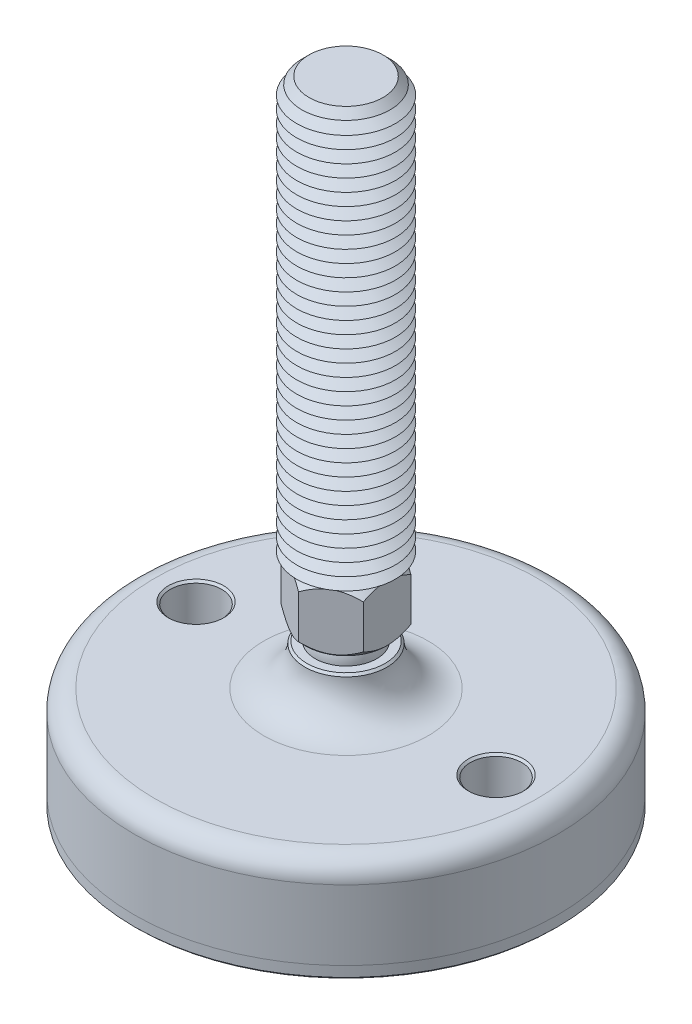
ISO-10303-21;
HEADER;
FILE_DESCRIPTION(('STEP AP214'),'2;1');
FILE_NAME('part.step','',(''),(''),'','','');
FILE_SCHEMA(('AUTOMOTIVE_DESIGN { 1 0 10303 214 1 1 1 1 }'));
ENDSEC;
DATA;
#1=APPLICATION_CONTEXT('core data for automotive mechanical design processes');
#2=APPLICATION_PROTOCOL_DEFINITION('international standard','automotive_design',2000,#1);
#3=PRODUCT_CONTEXT('',#1,'mechanical');
#4=PRODUCT('Part','Part','',(#3));
#5=PRODUCT_RELATED_PRODUCT_CATEGORY('part','',(#4));
#6=PRODUCT_DEFINITION_FORMATION('','',#4);
#7=PRODUCT_DEFINITION_CONTEXT('part definition',#1,'design');
#8=PRODUCT_DEFINITION('design','',#6,#7);
#9=PRODUCT_DEFINITION_SHAPE('','',#8);
#10=(LENGTH_UNIT() NAMED_UNIT(*) SI_UNIT(.MILLI.,.METRE.));
#11=(NAMED_UNIT(*) PLANE_ANGLE_UNIT() SI_UNIT($,.RADIAN.));
#12=(NAMED_UNIT(*) SI_UNIT($,.STERADIAN.) SOLID_ANGLE_UNIT());
#13=UNCERTAINTY_MEASURE_WITH_UNIT(LENGTH_MEASURE(1.E-05),#10,'distance_accuracy_value','');
#14=(GEOMETRIC_REPRESENTATION_CONTEXT(3) GLOBAL_UNCERTAINTY_ASSIGNED_CONTEXT((#13)) GLOBAL_UNIT_ASSIGNED_CONTEXT((#10,
#11,#12)) REPRESENTATION_CONTEXT('',''));
#15=CARTESIAN_POINT('',(0.,0.,0.));
#16=DIRECTION('',(0.,0.,1.));
#17=DIRECTION('',(1.,0.,0.));
#18=AXIS2_PLACEMENT_3D('',#15,#16,#17);
#19=CARTESIAN_POINT('',(0.,-32.,0.));
#20=DIRECTION('',(0.,1.,0.));
#21=DIRECTION('',(0.,0.,1.));
#22=AXIS2_PLACEMENT_3D('',#19,#20,#21);
#23=PLANE('',#22);
#24=CARTESIAN_POINT('',(-36.5,-32.,0.));
#25=DIRECTION('',(0.,1.,0.));
#26=DIRECTION('',(0.,0.,1.));
#27=AXIS2_PLACEMENT_3D('',#24,#25,#26);
#28=CIRCLE('',#27,6.25);
#29=CARTESIAN_POINT('',(-36.5,-32.,6.25));
#30=VERTEX_POINT('',#29);
#31=EDGE_CURVE('P0_E43',#30,#30,#28,.T.);
#32=ORIENTED_EDGE('',*,*,#31,.F.);
#33=EDGE_LOOP('',(#32));
#34=FACE_BOUND('',#33,.T.);
#35=CARTESIAN_POINT('',(36.5,-32.,0.));
#36=DIRECTION('',(0.,1.,0.));
#37=DIRECTION('',(0.,0.,1.));
#38=AXIS2_PLACEMENT_3D('',#35,#36,#37);
#39=CIRCLE('',#38,6.25);
#40=CARTESIAN_POINT('',(36.5,-32.,6.25));
#41=VERTEX_POINT('',#40);
#42=EDGE_CURVE('P0_E44',#41,#41,#39,.T.);
#43=ORIENTED_EDGE('',*,*,#42,.F.);
#44=EDGE_LOOP('',(#43));
#45=FACE_BOUND('',#44,.T.);
#46=CARTESIAN_POINT('',(0.,-32.,0.));
#47=DIRECTION('',(0.,1.,0.));
#48=DIRECTION('',(0.,0.,1.));
#49=AXIS2_PLACEMENT_3D('',#46,#47,#48);
#50=CIRCLE('',#49,51.5);
#51=CARTESIAN_POINT('',(0.,-32.,51.5));
#52=VERTEX_POINT('',#51);
#53=EDGE_CURVE('P0_E40',#52,#52,#50,.T.);
#54=ORIENTED_EDGE('',*,*,#53,.T.);
#55=EDGE_LOOP('',(#54));
#56=FACE_BOUND('',#55,.T.);
#57=ADVANCED_FACE('P0_F14',(#34,#45,#56),#23,.T.);
#58=CARTESIAN_POINT('',(0.,43.1654938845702,0.));
#59=DIRECTION('',(0.,1.,0.));
#60=DIRECTION('',(0.,0.,1.));
#61=AXIS2_PLACEMENT_3D('',#58,#59,#60);
#62=CYLINDRICAL_SURFACE('',#61,51.5);
#63=CARTESIAN_POINT('',(0.,-34.5,0.));
#64=DIRECTION('',(0.,-1.,0.));
#65=DIRECTION('',(0.,0.,-1.));
#66=AXIS2_PLACEMENT_3D('',#63,#64,#65);
#67=CIRCLE('',#66,51.5);
#68=CARTESIAN_POINT('',(0.,-34.5,-51.5));
#69=VERTEX_POINT('',#68);
#70=EDGE_CURVE('P0_E37',#69,#69,#67,.F.);
#71=ORIENTED_EDGE('',*,*,#70,.T.);
#72=EDGE_LOOP('',(#71));
#73=FACE_BOUND('',#72,.T.);
#74=ORIENTED_EDGE('',*,*,#53,.F.);
#75=EDGE_LOOP('',(#74));
#76=FACE_BOUND('',#75,.T.);
#77=ADVANCED_FACE('P0_F54',(#73,#76),#62,.T.);
#78=CARTESIAN_POINT('',(0.,-35.,51.5));
#79=DIRECTION('',(0.,-1.,0.));
#80=DIRECTION('',(0.,0.,-1.));
#81=AXIS2_PLACEMENT_3D('',#78,#79,#80);
#82=PLANE('',#81);
#83=CARTESIAN_POINT('',(36.5,-35.,0.));
#84=DIRECTION('',(0.,-1.,0.));
#85=DIRECTION('',(0.,0.,-1.));
#86=AXIS2_PLACEMENT_3D('',#83,#84,#85);
#87=CIRCLE('',#86,6.75000000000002);
#88=CARTESIAN_POINT('',(36.5,-35.,-6.75000000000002));
#89=VERTEX_POINT('',#88);
#90=EDGE_CURVE('P0_E25',#89,#89,#87,.F.);
#91=ORIENTED_EDGE('',*,*,#90,.T.);
#92=EDGE_LOOP('',(#91));
#93=FACE_BOUND('',#92,.T.);
#94=CARTESIAN_POINT('',(-36.5,-35.,0.));
#95=DIRECTION('',(0.,-1.,0.));
#96=DIRECTION('',(0.,0.,-1.));
#97=AXIS2_PLACEMENT_3D('',#94,#95,#96);
#98=CIRCLE('',#97,6.74999999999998);
#99=CARTESIAN_POINT('',(-36.5,-35.,-6.74999999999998));
#100=VERTEX_POINT('',#99);
#101=EDGE_CURVE('P0_E29',#100,#100,#98,.F.);
#102=ORIENTED_EDGE('',*,*,#101,.T.);
#103=EDGE_LOOP('',(#102));
#104=FACE_BOUND('',#103,.T.);
#105=CARTESIAN_POINT('',(0.,-35.,0.));
#106=DIRECTION('',(0.,-1.,0.));
#107=DIRECTION('',(0.,0.,-1.));
#108=AXIS2_PLACEMENT_3D('',#105,#106,#107);
#109=CIRCLE('',#108,51.);
#110=CARTESIAN_POINT('',(0.,-35.,-51.));
#111=VERTEX_POINT('',#110);
#112=EDGE_CURVE('P0_E34',#111,#111,#109,.T.);
#113=ORIENTED_EDGE('',*,*,#112,.T.);
#114=EDGE_LOOP('',(#113));
#115=FACE_BOUND('',#114,.T.);
#116=ADVANCED_FACE('P0_F61',(#93,#104,#115),#82,.T.);
#117=CARTESIAN_POINT('',(0.,-34.5,0.));
#118=DIRECTION('',(0.,1.,0.));
#119=DIRECTION('',(0.,0.,1.));
#120=AXIS2_PLACEMENT_3D('',#117,#118,#119);
#121=CONICAL_SURFACE('',#120,51.5,0.785398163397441);
#122=ORIENTED_EDGE('',*,*,#112,.F.);
#123=EDGE_LOOP('',(#122));
#124=FACE_BOUND('',#123,.T.);
#125=ORIENTED_EDGE('',*,*,#70,.F.);
#126=EDGE_LOOP('',(#125));
#127=FACE_BOUND('',#126,.T.);
#128=ADVANCED_FACE('P0_F68',(#124,#127),#121,.T.);
#129=CARTESIAN_POINT('',(36.5,-35.,0.));
#130=DIRECTION('',(0.,1.,0.));
#131=DIRECTION('',(0.,0.,1.));
#132=AXIS2_PLACEMENT_3D('',#129,#130,#131);
#133=CYLINDRICAL_SURFACE('',#132,6.25);
#134=CARTESIAN_POINT('',(36.5,-34.5,0.));
#135=DIRECTION('',(0.,-1.,0.));
#136=DIRECTION('',(0.,0.,-1.));
#137=AXIS2_PLACEMENT_3D('',#134,#135,#136);
#138=CIRCLE('',#137,6.25);
#139=CARTESIAN_POINT('',(36.5,-34.5,-6.25));
#140=VERTEX_POINT('',#139);
#141=EDGE_CURVE('P0_E21',#140,#140,#138,.T.);
#142=ORIENTED_EDGE('',*,*,#141,.T.);
#143=EDGE_LOOP('',(#142));
#144=FACE_BOUND('',#143,.T.);
#145=ORIENTED_EDGE('',*,*,#42,.T.);
#146=EDGE_LOOP('',(#145));
#147=FACE_BOUND('',#146,.T.);
#148=ADVANCED_FACE('P0_F74',(#144,#147),#133,.F.);
#149=CARTESIAN_POINT('',(-36.5,-35.,0.));
#150=DIRECTION('',(0.,1.,0.));
#151=DIRECTION('',(0.,0.,1.));
#152=AXIS2_PLACEMENT_3D('',#149,#150,#151);
#153=CYLINDRICAL_SURFACE('',#152,6.25);
#154=CARTESIAN_POINT('',(-36.5,-34.5,0.));
#155=DIRECTION('',(0.,-1.,0.));
#156=DIRECTION('',(0.,0.,-1.));
#157=AXIS2_PLACEMENT_3D('',#154,#155,#156);
#158=CIRCLE('',#157,6.25);
#159=CARTESIAN_POINT('',(-36.5,-34.5,-6.25));
#160=VERTEX_POINT('',#159);
#161=EDGE_CURVE('P0_E10',#160,#160,#158,.T.);
#162=ORIENTED_EDGE('',*,*,#161,.T.);
#163=EDGE_LOOP('',(#162));
#164=FACE_BOUND('',#163,.T.);
#165=ORIENTED_EDGE('',*,*,#31,.T.);
#166=EDGE_LOOP('',(#165));
#167=FACE_BOUND('',#166,.T.);
#168=ADVANCED_FACE('P0_F50',(#164,#167),#153,.F.);
#169=CARTESIAN_POINT('',(36.5,-35.,0.));
#170=DIRECTION('',(0.,-1.,0.));
#171=DIRECTION('',(0.,0.,-1.));
#172=AXIS2_PLACEMENT_3D('',#169,#170,#171);
#173=CONICAL_SURFACE('',#172,6.75000000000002,0.785398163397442);
#174=ORIENTED_EDGE('',*,*,#141,.F.);
#175=EDGE_LOOP('',(#174));
#176=FACE_BOUND('',#175,.T.);
#177=ORIENTED_EDGE('',*,*,#90,.F.);
#178=EDGE_LOOP('',(#177));
#179=FACE_BOUND('',#178,.T.);
#180=ADVANCED_FACE('P0_F76',(#176,#179),#173,.F.);
#181=CARTESIAN_POINT('',(-36.5,-35.,0.));
#182=DIRECTION('',(0.,-1.,0.));
#183=DIRECTION('',(0.,0.,-1.));
#184=AXIS2_PLACEMENT_3D('',#181,#182,#183);
#185=CONICAL_SURFACE('',#184,6.74999999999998,0.785398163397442);
#186=ORIENTED_EDGE('',*,*,#161,.F.);
#187=EDGE_LOOP('',(#186));
#188=FACE_BOUND('',#187,.T.);
#189=ORIENTED_EDGE('',*,*,#101,.F.);
#190=EDGE_LOOP('',(#189));
#191=FACE_BOUND('',#190,.T.);
#192=ADVANCED_FACE('P0_F16',(#188,#191),#185,.F.);
#193=CLOSED_SHELL('',(#57,#77,#116,#128,#148,#168,#180,#192));
#194=MANIFOLD_SOLID_BREP('P0_B1',#193);
#195=CARTESIAN_POINT('',(0.,3.75,0.));
#196=DIRECTION('',(0.,1.,0.));
#197=DIRECTION('',(0.,0.,1.));
#198=AXIS2_PLACEMENT_3D('',#195,#196,#197);
#199=PLANE('',#198);
#200=CARTESIAN_POINT('',(0.,3.75,0.));
#201=DIRECTION('',(0.,1.,0.));
#202=DIRECTION('',(0.,0.,1.));
#203=AXIS2_PLACEMENT_3D('',#200,#201,#202);
#204=CIRCLE('',#203,9.72829454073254);
#205=CARTESIAN_POINT('',(0.,3.75,9.72829454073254));
#206=VERTEX_POINT('',#205);
#207=EDGE_CURVE('P1_E213',#206,#206,#204,.T.);
#208=ORIENTED_EDGE('',*,*,#207,.F.);
#209=EDGE_LOOP('',(#208));
#210=FACE_BOUND('',#209,.T.);
#211=CARTESIAN_POINT('',(0.,3.75,0.));
#212=DIRECTION('',(0.,1.,0.));
#213=DIRECTION('',(0.,0.,1.));
#214=AXIS2_PLACEMENT_3D('',#211,#212,#213);
#215=CIRCLE('',#214,6.49519052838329);
#216=CARTESIAN_POINT('',(0.,3.75,6.49519052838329));
#217=VERTEX_POINT('',#216);
#218=EDGE_CURVE('P1_E25',#217,#217,#215,.F.);
#219=ORIENTED_EDGE('',*,*,#218,.F.);
#220=EDGE_LOOP('',(#219));
#221=FACE_BOUND('',#220,.T.);
#222=ADVANCED_FACE('P1_F16',(#210,#221),#199,.F.);
#223=CARTESIAN_POINT('',(0.,0.,0.));
#224=DIRECTION('',(0.,1.,0.));
#225=DIRECTION('',(0.,0.,-1.));
#226=AXIS2_PLACEMENT_3D('',#223,#224,#225);
#227=SPHERICAL_SURFACE('',#226,7.5);
#228=ORIENTED_EDGE('',*,*,#218,.T.);
#229=EDGE_LOOP('',(#228));
#230=FACE_BOUND('',#229,.T.);
#231=ADVANCED_FACE('P1_F203',(#230),#227,.T.);
#232=CARTESIAN_POINT('',(0.,3.75,0.));
#233=DIRECTION('',(0.,1.,0.));
#234=DIRECTION('',(0.,0.,1.));
#235=AXIS2_PLACEMENT_3D('',#232,#233,#234);
#236=CONICAL_SURFACE('',#235,9.72829454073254,0.785398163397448);
#237=ORIENTED_EDGE('',*,*,#207,.T.);
#238=EDGE_LOOP('',(#237));
#239=FACE_BOUND('',#238,.T.);
#240=CARTESIAN_POINT('',(-10.,9.59571642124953,-11.9394228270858));
#241=CARTESIAN_POINT('',(-10.,9.37430561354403,-11.6505452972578));
#242=CARTESIAN_POINT('',(-10.,9.15490936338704,-11.3600988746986));
#243=CARTESIAN_POINT('',(-10.,8.72106267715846,-10.7754314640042));
#244=CARTESIAN_POINT('',(-10.,8.50661343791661,-10.4812095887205));
#245=CARTESIAN_POINT('',(-10.,8.08205114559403,-9.88620330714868));
#246=CARTESIAN_POINT('',(-10.,7.87198437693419,-9.58538576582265));
#247=CARTESIAN_POINT('',(-10.,7.45926520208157,-8.97872312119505));
#248=CARTESIAN_POINT('',(-10.,7.25661228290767,-8.67287836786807));
#249=CARTESIAN_POINT('',(-10.,6.84809543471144,-8.03614350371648));
#250=CARTESIAN_POINT('',(-10.,6.64281401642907,-7.70487777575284));
#251=CARTESIAN_POINT('',(-10.,6.245142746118,-7.03457466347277));
#252=CARTESIAN_POINT('',(-10.,6.0527550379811,-6.69553599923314));
#253=CARTESIAN_POINT('',(-10.,5.68497951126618,-6.00961937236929));
#254=CARTESIAN_POINT('',(-10.,5.50954176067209,-5.66276839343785));
#255=CARTESIAN_POINT('',(-10.,5.17959635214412,-4.95932933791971));
#256=CARTESIAN_POINT('',(-10.,5.02507889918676,-4.60274591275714));
#257=CARTESIAN_POINT('',(-10.,4.75599518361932,-3.91353381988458));
#258=CARTESIAN_POINT('',(-10.,4.63902686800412,-3.58185263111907));
#259=CARTESIAN_POINT('',(-10.,4.43164927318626,-2.91013341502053));
#260=CARTESIAN_POINT('',(-10.,4.34124171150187,-2.57009484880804));
#261=CARTESIAN_POINT('',(-10.,4.19334931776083,-1.88955843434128));
#262=CARTESIAN_POINT('',(-10.,4.13527351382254,-1.54919119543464));
#263=CARTESIAN_POINT('',(-10.,4.05324021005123,-0.864347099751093));
#264=CARTESIAN_POINT('',(-10.,4.029275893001,-0.519871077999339));
#265=CARTESIAN_POINT('',(-10.,4.01745435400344,0.155191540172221));
#266=CARTESIAN_POINT('',(-10.,4.02812008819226,0.485752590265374));
#267=CARTESIAN_POINT('',(-10.,4.08160326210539,1.1442457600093));
#268=CARTESIAN_POINT('',(-10.,4.12442366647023,1.47217763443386));
#269=CARTESIAN_POINT('',(-10.,4.24054019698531,2.12859326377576));
#270=CARTESIAN_POINT('',(-10.,4.31437036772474,2.45698095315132));
#271=CARTESIAN_POINT('',(-10.,4.48844287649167,3.10654175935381));
#272=CARTESIAN_POINT('',(-10.,4.58868356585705,3.42771532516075));
#273=CARTESIAN_POINT('',(-10.,4.81839210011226,4.08271396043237));
#274=CARTESIAN_POINT('',(-10.,4.94932842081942,4.41601827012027));
#275=CARTESIAN_POINT('',(-10.,5.23140828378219,5.07403931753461));
#276=CARTESIAN_POINT('',(-10.,5.38256099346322,5.3987520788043));
#277=CARTESIAN_POINT('',(-10.,5.70148727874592,6.04113299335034));
#278=CARTESIAN_POINT('',(-10.,5.86931223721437,6.35877542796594));
#279=CARTESIAN_POINT('',(-10.,6.21788686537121,6.98677627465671));
#280=CARTESIAN_POINT('',(-10.,6.39863453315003,7.29713580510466));
#281=CARTESIAN_POINT('',(-10.,6.76133545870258,7.89633938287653));
#282=CARTESIAN_POINT('',(-10.,6.94278731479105,8.18548854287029));
#283=CARTESIAN_POINT('',(-10.,7.31339871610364,8.75881961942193));
#284=CARTESIAN_POINT('',(-10.,7.50255884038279,9.04300116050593));
#285=CARTESIAN_POINT('',(-10.,7.8856676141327,9.6047584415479));
#286=CARTESIAN_POINT('',(-10.,8.07956548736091,9.88236893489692));
#287=CARTESIAN_POINT('',(-10.,8.47254700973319,10.4337838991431));
#288=CARTESIAN_POINT('',(-10.,8.67162921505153,10.7075893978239));
#289=CARTESIAN_POINT('',(-10.,8.87283307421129,10.9797992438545));
#290=B_SPLINE_CURVE_WITH_KNOTS('',3,(#240,#241,#242,#243,#244,#245,#246,#247,#248,#249,#250,
#251,#252,#253,#254,#255,#256,#257,#258,#259,#260,#261,#262,#263,#264,#265,#266,#267,#268,#269,
#270,#271,#272,#273,#274,#275,#276,#277,#278,#279,#280,#281,#282,#283,#284,#285,#286,#287,#288,
#289),.UNSPECIFIED.,.F.,.F.,(4,2,2,2,2,2,2,2,2,2,2,2,2,2,2,2,2,2,2,2,2,2,2,2,4),(0.,
1.09192545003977,2.18411235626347,3.28473497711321,4.3852812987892,5.5541916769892,
6.72329593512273,7.88884387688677,9.05384420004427,10.1080362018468,11.1622963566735,
12.1965943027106,13.2306855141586,14.2212593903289,15.2119246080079,16.2203997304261,
17.2288119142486,18.3022883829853,19.3762532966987,20.4536373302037,21.5308548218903,
22.5548150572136,23.5788523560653,24.5946500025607,25.6101677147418),.UNSPECIFIED.);
#291=CARTESIAN_POINT('',(-10.,5.56871084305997,-5.77350269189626));
#292=VERTEX_POINT('',#291);
#293=CARTESIAN_POINT('',(-10.,5.56871084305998,5.77350269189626));
#294=VERTEX_POINT('',#293);
#295=EDGE_CURVE('P1_E187',#292,#294,#290,.T.);
#296=ORIENTED_EDGE('',*,*,#295,.F.);
#297=CARTESIAN_POINT('',(0.000199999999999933,5.56882631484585,-11.5471208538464));
#298=CARTESIAN_POINT('',(-0.171722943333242,5.4695807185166,-11.447861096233));
#299=CARTESIAN_POINT('',(-0.344992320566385,5.37336355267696,-11.3478239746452));
#300=CARTESIAN_POINT('',(-0.694433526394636,5.18794806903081,-11.1460740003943));
#301=CARTESIAN_POINT('',(-0.870606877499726,5.09875358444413,-11.0443602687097));
#302=CARTESIAN_POINT('',(-1.22689656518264,4.92796770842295,-10.8386563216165));
#303=CARTESIAN_POINT('',(-1.40702970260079,4.84642277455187,-10.7346564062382));
#304=CARTESIAN_POINT('',(-1.77025459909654,4.69270708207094,-10.52494841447));
#305=CARTESIAN_POINT('',(-1.95334590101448,4.62053489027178,-10.4192406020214));
#306=CARTESIAN_POINT('',(-2.31954331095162,4.4878482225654,-10.2078164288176));
#307=CARTESIAN_POINT('',(-2.50260441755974,4.42716910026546,-10.1021260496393));
#308=CARTESIAN_POINT('',(-2.87129282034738,4.31731511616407,-9.88926370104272));
#309=CARTESIAN_POINT('',(-3.05691983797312,4.26813901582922,-9.78209189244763));
#310=CARTESIAN_POINT('',(-3.42994608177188,4.1825291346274,-9.56672509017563));
#311=CARTESIAN_POINT('',(-3.61734032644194,4.14606667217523,-9.45853297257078));
#312=CARTESIAN_POINT('',(-3.99370204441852,4.08668528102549,-9.24124043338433));
#313=CARTESIAN_POINT('',(-4.1826692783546,4.06376432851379,-9.13214015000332));
#314=CARTESIAN_POINT('',(-4.64316633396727,4.0253323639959,-8.86627205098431));
#315=CARTESIAN_POINT('',(-4.91519388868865,4.01726744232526,-8.70921686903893));
#316=CARTESIAN_POINT('',(-5.45875701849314,4.03080424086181,-8.39539054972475));
#317=CARTESIAN_POINT('',(-5.7302923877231,4.05241636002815,-8.23861953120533));
#318=CARTESIAN_POINT('',(-6.27080349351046,4.12403157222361,-7.92655529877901));
#319=CARTESIAN_POINT('',(-6.53977602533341,4.17406641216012,-7.77126393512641));
#320=CARTESIAN_POINT('',(-7.07309796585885,4.29980733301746,-7.46335036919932));
#321=CARTESIAN_POINT('',(-7.33744772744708,4.3755114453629,-7.31072796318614));
#322=CARTESIAN_POINT('',(-7.80670351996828,4.53125365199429,-7.03980300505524));
#323=CARTESIAN_POINT('',(-8.01264886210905,4.60719488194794,-6.92090040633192));
#324=CARTESIAN_POINT('',(-8.42084280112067,4.77131434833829,-6.68522952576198));
#325=CARTESIAN_POINT('',(-8.62309128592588,4.85949295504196,-6.5684613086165));
#326=CARTESIAN_POINT('',(-9.02325448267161,5.04611070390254,-6.33742697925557));
#327=CARTESIAN_POINT('',(-9.22118057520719,5.1445175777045,-6.2231542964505));
#328=CARTESIAN_POINT('',(-9.61336795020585,5.35030005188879,-5.99672480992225));
#329=CARTESIAN_POINT('',(-9.80763139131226,5.45767015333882,-5.88456675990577));
#330=CARTESIAN_POINT('',(-10.0002,5.56882631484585,-5.77338722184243));
#331=B_SPLINE_CURVE_WITH_KNOTS('',3,(#297,#298,#299,#300,#301,#302,#303,#304,#305,#306,#307,
#308,#309,#310,#311,#312,#313,#314,#315,#316,#317,#318,#319,#320,#321,#322,#323,#324,#325,#326,
#327,#328,#329,#330),.UNSPECIFIED.,.F.,.F.,(4,2,2,2,2,2,2,2,2,2,2,2,2,2,2,2,4),(0.,
0.665863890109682,1.33208874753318,2.00212824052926,2.67206515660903,3.33152613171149,
3.99091606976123,4.64880867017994,5.30660292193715,6.24777541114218,7.18927777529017,
8.13183382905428,9.07431761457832,9.82287578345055,10.5714566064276,11.3177436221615,
12.0635761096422),.UNSPECIFIED.);
#332=CARTESIAN_POINT('',(0.,5.56871084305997,-11.5470053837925));
#333=VERTEX_POINT('',#332);
#334=EDGE_CURVE('P1_E181',#333,#292,#331,.T.);
#335=ORIENTED_EDGE('',*,*,#334,.F.);
#336=CARTESIAN_POINT('',(10.0002,5.56882631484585,-5.77338722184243));
#337=CARTESIAN_POINT('',(9.82827705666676,5.4695807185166,-5.87264697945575));
#338=CARTESIAN_POINT('',(9.65500767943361,5.37336355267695,-5.97268410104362));
#339=CARTESIAN_POINT('',(9.30556647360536,5.18794806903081,-6.17443407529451));
#340=CARTESIAN_POINT('',(9.12939312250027,5.09875358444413,-6.27614780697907));
#341=CARTESIAN_POINT('',(8.77310343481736,4.92796770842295,-6.48185175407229));
#342=CARTESIAN_POINT('',(8.59297029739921,4.84642277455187,-6.58585166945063));
#343=CARTESIAN_POINT('',(8.22974540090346,4.69270708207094,-6.79555966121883));
#344=CARTESIAN_POINT('',(8.04665409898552,4.62053489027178,-6.90126747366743));
#345=CARTESIAN_POINT('',(7.68045668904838,4.4878482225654,-7.11269164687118));
#346=CARTESIAN_POINT('',(7.49739558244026,4.42716910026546,-7.21838202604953));
#347=CARTESIAN_POINT('',(7.12870717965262,4.31731511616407,-7.43124437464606));
#348=CARTESIAN_POINT('',(6.94308016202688,4.26813901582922,-7.53841618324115));
#349=CARTESIAN_POINT('',(6.57005391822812,4.1825291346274,-7.75378298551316));
#350=CARTESIAN_POINT('',(6.38265967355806,4.14606667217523,-7.861975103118));
#351=CARTESIAN_POINT('',(6.00629795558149,4.08668528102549,-8.07926764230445));
#352=CARTESIAN_POINT('',(5.81733072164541,4.06376432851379,-8.18836792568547));
#353=CARTESIAN_POINT('',(5.35683366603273,4.0253323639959,-8.45423602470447));
#354=CARTESIAN_POINT('',(5.08480611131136,4.01726744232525,-8.61129120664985));
#355=CARTESIAN_POINT('',(4.54124298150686,4.03080424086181,-8.92511752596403));
#356=CARTESIAN_POINT('',(4.2697076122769,4.05241636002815,-9.08188854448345));
#357=CARTESIAN_POINT('',(3.72919650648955,4.12403157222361,-9.39395277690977));
#358=CARTESIAN_POINT('',(3.46022397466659,4.17406641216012,-9.54924414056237));
#359=CARTESIAN_POINT('',(2.92690203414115,4.29980733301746,-9.85715770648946));
#360=CARTESIAN_POINT('',(2.66255227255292,4.37551144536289,-10.0097801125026));
#361=CARTESIAN_POINT('',(2.19329648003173,4.53125365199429,-10.2807050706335));
#362=CARTESIAN_POINT('',(1.98735113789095,4.60719488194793,-10.3996076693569));
#363=CARTESIAN_POINT('',(1.57915719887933,4.77131434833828,-10.6352785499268));
#364=CARTESIAN_POINT('',(1.37690871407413,4.85949295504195,-10.7520467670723));
#365=CARTESIAN_POINT('',(0.976745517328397,5.04611070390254,-10.9830810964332));
#366=CARTESIAN_POINT('',(0.77881942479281,5.1445175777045,-11.0973537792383));
#367=CARTESIAN_POINT('',(0.386632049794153,5.35030005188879,-11.3237832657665));
#368=CARTESIAN_POINT('',(0.192368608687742,5.45767015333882,-11.435941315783));
#369=CARTESIAN_POINT('',(-0.000199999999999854,5.56882631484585,-11.5471208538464));
#370=B_SPLINE_CURVE_WITH_KNOTS('',3,(#336,#337,#338,#339,#340,#341,#342,#343,#344,#345,#346,
#347,#348,#349,#350,#351,#352,#353,#354,#355,#356,#357,#358,#359,#360,#361,#362,#363,#364,#365,
#366,#367,#368,#369),.UNSPECIFIED.,.F.,.F.,(4,2,2,2,2,2,2,2,2,2,2,2,2,2,2,2,4),(0.,
0.665863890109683,1.33208874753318,2.00212824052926,2.67206515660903,3.33152613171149,
3.99091606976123,4.64880867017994,5.30660292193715,6.24777541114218,7.18927777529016,
8.13183382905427,9.07431761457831,9.82287578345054,10.5714566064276,11.3177436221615,
12.0635761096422),.UNSPECIFIED.);
#371=CARTESIAN_POINT('',(9.99999999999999,5.56871084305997,-5.77350269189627));
#372=VERTEX_POINT('',#371);
#373=EDGE_CURVE('P1_E169',#372,#333,#370,.T.);
#374=ORIENTED_EDGE('',*,*,#373,.F.);
#375=CARTESIAN_POINT('',(10.,9.59571642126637,-11.9394228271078));
#376=CARTESIAN_POINT('',(10.,9.37430561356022,-11.6505452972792));
#377=CARTESIAN_POINT('',(10.,9.15490936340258,-11.3600988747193));
#378=CARTESIAN_POINT('',(10.,8.7210626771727,-10.7754314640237));
#379=CARTESIAN_POINT('',(10.,8.5066134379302,-10.4812095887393));
#380=CARTESIAN_POINT('',(10.,8.08205114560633,-9.88620330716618));
#381=CARTESIAN_POINT('',(10.,7.87198437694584,-9.58538576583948));
#382=CARTESIAN_POINT('',(10.,7.45926520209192,-8.97872312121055));
#383=CARTESIAN_POINT('',(10.,7.25661228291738,-8.67287836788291));
#384=CARTESIAN_POINT('',(10.,6.84809543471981,-8.03614350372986));
#385=CARTESIAN_POINT('',(10.,6.64281401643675,-7.70487777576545));
#386=CARTESIAN_POINT('',(10.,6.24514274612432,-7.03457466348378));
#387=CARTESIAN_POINT('',(10.,6.05275503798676,-6.69553599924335));
#388=CARTESIAN_POINT('',(10.,5.68497951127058,-6.00961937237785));
#389=CARTESIAN_POINT('',(10.,5.50954176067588,-5.66276839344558));
#390=CARTESIAN_POINT('',(10.,5.17959635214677,-4.95932933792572));
#391=CARTESIAN_POINT('',(10.,5.02507889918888,-4.60274591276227));
#392=CARTESIAN_POINT('',(10.,4.75599518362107,-3.91353381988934));
#393=CARTESIAN_POINT('',(10.,4.63902686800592,-3.58185263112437));
#394=CARTESIAN_POINT('',(10.,4.43164927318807,-2.91013341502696));
#395=CARTESIAN_POINT('',(10.,4.34124171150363,-2.57009484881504));
#396=CARTESIAN_POINT('',(10.,4.19334931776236,-1.8895584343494));
#397=CARTESIAN_POINT('',(10.,4.13527351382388,-1.54919119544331));
#398=CARTESIAN_POINT('',(10.,4.05324021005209,-0.86434709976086));
#399=CARTESIAN_POINT('',(10.,4.02927589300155,-0.519871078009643));
#400=CARTESIAN_POINT('',(10.,4.01745435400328,0.155191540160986));
#401=CARTESIAN_POINT('',(10.,4.0281200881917,0.485752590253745));
#402=CARTESIAN_POINT('',(10.,4.08160326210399,1.14424575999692));
#403=CARTESIAN_POINT('',(10.,4.12442366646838,1.47217763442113));
#404=CARTESIAN_POINT('',(10.,4.24054019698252,2.12859326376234));
#405=CARTESIAN_POINT('',(10.,4.31437036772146,2.45698095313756));
#406=CARTESIAN_POINT('',(10.,4.48844287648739,3.1065417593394));
#407=CARTESIAN_POINT('',(10.,4.58868356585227,3.42771532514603));
#408=CARTESIAN_POINT('',(10.,4.81839210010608,4.08271396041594));
#409=CARTESIAN_POINT('',(10.,4.94932842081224,4.41601827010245));
#410=CARTESIAN_POINT('',(10.,5.23140828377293,5.0740393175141));
#411=CARTESIAN_POINT('',(10.,5.38256099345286,5.39875207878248));
#412=CARTESIAN_POINT('',(10.,5.70148727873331,6.04113299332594));
#413=CARTESIAN_POINT('',(10.,5.86931223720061,6.35877542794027));
#414=CARTESIAN_POINT('',(10.,6.21788686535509,6.98677627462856));
#415=CARTESIAN_POINT('',(10.,6.39863453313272,7.29713580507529));
#416=CARTESIAN_POINT('',(10.,6.761335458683,7.89633938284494));
#417=CARTESIAN_POINT('',(10.,6.9427873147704,8.18548854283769));
#418=CARTESIAN_POINT('',(10.,7.31339871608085,8.75881961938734));
#419=CARTESIAN_POINT('',(10.,7.50255884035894,9.04300116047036));
#420=CARTESIAN_POINT('',(10.,7.88566761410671,9.60475844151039));
#421=CARTESIAN_POINT('',(10.,8.07956548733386,9.88236893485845));
#422=CARTESIAN_POINT('',(10.,8.47254700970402,10.4337838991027));
#423=CARTESIAN_POINT('',(10.,8.6716292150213,10.7075893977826));
#424=CARTESIAN_POINT('',(10.,8.87283307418,10.9797992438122));
#425=B_SPLINE_CURVE_WITH_KNOTS('',3,(#375,#376,#377,#378,#379,#380,#381,#382,#383,#384,#385,
#386,#387,#388,#389,#390,#391,#392,#393,#394,#395,#396,#397,#398,#399,#400,#401,#402,#403,#404,
#405,#406,#407,#408,#409,#410,#411,#412,#413,#414,#415,#416,#417,#418,#419,#420,#421,#422,#423,
#424),.UNSPECIFIED.,.F.,.F.,(4,2,2,2,2,2,2,2,2,2,2,2,2,2,2,2,2,2,2,2,2,2,2,2,4),(0.,
1.09192545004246,2.18411235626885,3.28473497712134,4.38528129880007,5.55419167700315,
6.72329593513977,7.88884387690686,9.05384420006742,10.1080362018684,11.1622963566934,
12.196594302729,13.2306855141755,14.2212593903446,15.2119246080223,16.2203997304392,
17.2288119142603,18.3022883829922,19.3762532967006,20.4536373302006,21.5308548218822,
22.5548150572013,23.5788523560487,24.5946500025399,25.6101677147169),.UNSPECIFIED.);
#426=CARTESIAN_POINT('',(10.,5.56871084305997,5.77350269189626));
#427=VERTEX_POINT('',#426);
#428=EDGE_CURVE('P1_E71',#427,#372,#425,.F.);
#429=ORIENTED_EDGE('',*,*,#428,.F.);
#430=CARTESIAN_POINT('',(-0.000200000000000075,5.56882631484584,11.5471208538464));
#431=CARTESIAN_POINT('',(0.171722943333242,5.4695807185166,11.447861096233));
#432=CARTESIAN_POINT('',(0.344992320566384,5.37336355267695,11.3478239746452));
#433=CARTESIAN_POINT('',(0.694433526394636,5.18794806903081,11.1460740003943));
#434=CARTESIAN_POINT('',(0.870606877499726,5.09875358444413,11.0443602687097));
#435=CARTESIAN_POINT('',(1.22689656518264,4.92796770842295,10.8386563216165));
#436=CARTESIAN_POINT('',(1.40702970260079,4.84642277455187,10.7346564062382));
#437=CARTESIAN_POINT('',(1.77025459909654,4.69270708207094,10.52494841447));
#438=CARTESIAN_POINT('',(1.95334590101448,4.62053489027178,10.4192406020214));
#439=CARTESIAN_POINT('',(2.31954331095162,4.4878482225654,10.2078164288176));
#440=CARTESIAN_POINT('',(2.50260441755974,4.42716910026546,10.1021260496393));
#441=CARTESIAN_POINT('',(2.87129282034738,4.31731511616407,9.88926370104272));
#442=CARTESIAN_POINT('',(3.05691983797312,4.26813901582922,9.78209189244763));
#443=CARTESIAN_POINT('',(3.42994608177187,4.18252913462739,9.56672509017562));
#444=CARTESIAN_POINT('',(3.61734032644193,4.14606667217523,9.45853297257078));
#445=CARTESIAN_POINT('',(3.99370204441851,4.08668528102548,9.24124043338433));
#446=CARTESIAN_POINT('',(4.18266927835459,4.06376432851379,9.13214015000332));
#447=CARTESIAN_POINT('',(4.64316633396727,4.0253323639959,8.86627205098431));
#448=CARTESIAN_POINT('',(4.91519388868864,4.01726744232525,8.70921686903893));
#449=CARTESIAN_POINT('',(5.45875701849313,4.03080424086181,8.39539054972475));
#450=CARTESIAN_POINT('',(5.7302923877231,4.05241636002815,8.23861953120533));
#451=CARTESIAN_POINT('',(6.27080349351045,4.1240315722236,7.92655529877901));
#452=CARTESIAN_POINT('',(6.53977602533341,4.17406641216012,7.77126393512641));
#453=CARTESIAN_POINT('',(7.07309796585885,4.29980733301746,7.46335036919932));
#454=CARTESIAN_POINT('',(7.33744772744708,4.37551144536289,7.31072796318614));
#455=CARTESIAN_POINT('',(7.80670351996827,4.53125365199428,7.03980300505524));
#456=CARTESIAN_POINT('',(8.01264886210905,4.60719488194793,6.92090040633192));
#457=CARTESIAN_POINT('',(8.42084280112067,4.77131434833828,6.68522952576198));
#458=CARTESIAN_POINT('',(8.62309128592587,4.85949295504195,6.5684613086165));
#459=CARTESIAN_POINT('',(9.0232544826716,5.04611070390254,6.33742697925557));
#460=CARTESIAN_POINT('',(9.22118057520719,5.1445175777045,6.2231542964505));
#461=CARTESIAN_POINT('',(9.61336795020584,5.35030005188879,5.99672480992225));
#462=CARTESIAN_POINT('',(9.80763139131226,5.45767015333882,5.88456675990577));
#463=CARTESIAN_POINT('',(10.0002,5.56882631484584,5.77338722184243));
#464=B_SPLINE_CURVE_WITH_KNOTS('',3,(#430,#431,#432,#433,#434,#435,#436,#437,#438,#439,#440,
#441,#442,#443,#444,#445,#446,#447,#448,#449,#450,#451,#452,#453,#454,#455,#456,#457,#458,#459,
#460,#461,#462,#463),.UNSPECIFIED.,.F.,.F.,(4,2,2,2,2,2,2,2,2,2,2,2,2,2,2,2,4),(0.,
0.665863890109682,1.33208874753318,2.00212824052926,2.67206515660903,3.33152613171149,
3.99091606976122,4.64880867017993,5.30660292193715,6.24777541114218,7.18927777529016,
8.13183382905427,9.07431761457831,9.82287578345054,10.5714566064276,11.3177436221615,
12.0635761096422),.UNSPECIFIED.);
#465=CARTESIAN_POINT('',(0.,5.56871084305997,11.5470053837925));
#466=VERTEX_POINT('',#465);
#467=EDGE_CURVE('P1_E68',#466,#427,#464,.T.);
#468=ORIENTED_EDGE('',*,*,#467,.F.);
#469=CARTESIAN_POINT('',(-10.0002,5.56882631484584,5.77338722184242));
#470=CARTESIAN_POINT('',(-9.82827705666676,5.4695807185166,5.87264697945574));
#471=CARTESIAN_POINT('',(-9.65500767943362,5.37336355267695,5.97268410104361));
#472=CARTESIAN_POINT('',(-9.30556647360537,5.18794806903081,6.1744340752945));
#473=CARTESIAN_POINT('',(-9.12939312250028,5.09875358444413,6.27614780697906));
#474=CARTESIAN_POINT('',(-8.77310343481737,4.92796770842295,6.48185175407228));
#475=CARTESIAN_POINT('',(-8.59297029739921,4.84642277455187,6.58585166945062));
#476=CARTESIAN_POINT('',(-8.22974540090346,4.69270708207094,6.79555966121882));
#477=CARTESIAN_POINT('',(-8.04665409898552,4.62053489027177,6.90126747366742));
#478=CARTESIAN_POINT('',(-7.68045668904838,4.48784822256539,7.11269164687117));
#479=CARTESIAN_POINT('',(-7.49739558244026,4.42716910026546,7.21838202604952));
#480=CARTESIAN_POINT('',(-7.12870717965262,4.31731511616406,7.43124437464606));
#481=CARTESIAN_POINT('',(-6.94308016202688,4.26813901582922,7.53841618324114));
#482=CARTESIAN_POINT('',(-6.57005391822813,4.18252913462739,7.75378298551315));
#483=CARTESIAN_POINT('',(-6.38265967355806,4.14606667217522,7.861975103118));
#484=CARTESIAN_POINT('',(-6.00629795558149,4.08668528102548,8.07926764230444));
#485=CARTESIAN_POINT('',(-5.81733072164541,4.06376432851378,8.18836792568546));
#486=CARTESIAN_POINT('',(-5.35683366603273,4.0253323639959,8.45423602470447));
#487=CARTESIAN_POINT('',(-5.08480611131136,4.01726744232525,8.61129120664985));
#488=CARTESIAN_POINT('',(-4.54124298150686,4.0308042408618,8.92511752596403));
#489=CARTESIAN_POINT('',(-4.2697076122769,4.05241636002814,9.08188854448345));
#490=CARTESIAN_POINT('',(-3.72919650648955,4.1240315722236,9.39395277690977));
#491=CARTESIAN_POINT('',(-3.46022397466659,4.17406641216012,9.54924414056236));
#492=CARTESIAN_POINT('',(-2.92690203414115,4.29980733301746,9.85715770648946));
#493=CARTESIAN_POINT('',(-2.66255227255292,4.37551144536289,10.0097801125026));
#494=CARTESIAN_POINT('',(-2.19329648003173,4.53125365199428,10.2807050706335));
#495=CARTESIAN_POINT('',(-1.98735113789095,4.60719488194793,10.3996076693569));
#496=CARTESIAN_POINT('',(-1.57915719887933,4.77131434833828,10.6352785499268));
#497=CARTESIAN_POINT('',(-1.37690871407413,4.85949295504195,10.7520467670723));
#498=CARTESIAN_POINT('',(-0.976745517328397,5.04611070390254,10.9830810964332));
#499=CARTESIAN_POINT('',(-0.778819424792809,5.1445175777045,11.0973537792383));
#500=CARTESIAN_POINT('',(-0.386632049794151,5.35030005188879,11.3237832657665));
#501=CARTESIAN_POINT('',(-0.192368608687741,5.45767015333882,11.435941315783));
#502=CARTESIAN_POINT('',(0.000199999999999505,5.56882631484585,11.5471208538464));
#503=B_SPLINE_CURVE_WITH_KNOTS('',3,(#469,#470,#471,#472,#473,#474,#475,#476,#477,#478,#479,
#480,#481,#482,#483,#484,#485,#486,#487,#488,#489,#490,#491,#492,#493,#494,#495,#496,#497,#498,
#499,#500,#501,#502),.UNSPECIFIED.,.F.,.F.,(4,2,2,2,2,2,2,2,2,2,2,2,2,2,2,2,4),(0.,
0.665863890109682,1.33208874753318,2.00212824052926,2.67206515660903,3.33152613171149,
3.99091606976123,4.64880867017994,5.30660292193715,6.24777541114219,7.18927777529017,
8.13183382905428,9.07431761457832,9.82287578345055,10.5714566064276,11.3177436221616,
12.0635761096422),.UNSPECIFIED.);
#504=EDGE_CURVE('P1_E40',#294,#466,#503,.T.);
#505=ORIENTED_EDGE('',*,*,#504,.F.);
#506=EDGE_LOOP('',(#296,#335,#374,#429,#468,#505));
#507=FACE_BOUND('',#506,.T.);
#508=ADVANCED_FACE('P1_F69',(#239,#507),#236,.T.);
#509=CARTESIAN_POINT('',(-10.,19.,-5.77350269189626));
#510=DIRECTION('',(1.,0.,0.));
#511=DIRECTION('',(0.,0.,-1.));
#512=AXIS2_PLACEMENT_3D('',#509,#510,#511);
#513=PLANE('',#512);
#514=DIRECTION('',(0.,-1.,0.));
#515=VECTOR('',#514,1.);
#516=CARTESIAN_POINT('',(-10.,19.,5.77350269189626));
#517=LINE('',#516,#515);
#518=CARTESIAN_POINT('',(-10.,16.1132486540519,5.77350269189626));
#519=VERTEX_POINT('',#518);
#520=EDGE_CURVE('P1_E84',#519,#294,#517,.T.);
#521=ORIENTED_EDGE('',*,*,#520,.F.);
#522=CARTESIAN_POINT('',(-10.,12.4093918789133,-11.5147208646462));
#523=CARTESIAN_POINT('',(-10.,12.6210295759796,-11.2343500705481));
#524=CARTESIAN_POINT('',(-10.,12.8306215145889,-10.9524094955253));
#525=CARTESIAN_POINT('',(-10.,13.2447979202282,-10.3847695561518));
#526=CARTESIAN_POINT('',(-10.,13.4493811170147,-10.0990692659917));
#527=CARTESIAN_POINT('',(-10.,13.8540786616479,-9.52120077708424));
#528=CARTESIAN_POINT('',(-10.,14.0541461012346,-9.22899961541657));
#529=CARTESIAN_POINT('',(-10.,14.4468132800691,-8.63963749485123));
#530=CARTESIAN_POINT('',(-10.,14.6394135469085,-8.34247688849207));
#531=CARTESIAN_POINT('',(-10.,15.0262335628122,-7.72525702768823));
#532=CARTESIAN_POINT('',(-10.,15.2199166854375,-7.40485974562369));
#533=CARTESIAN_POINT('',(-10.,15.5945399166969,-6.75658646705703));
#534=CARTESIAN_POINT('',(-10.,15.7754780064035,-6.4287092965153));
#535=CARTESIAN_POINT('',(-10.,16.1207071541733,-5.76550673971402));
#536=CARTESIAN_POINT('',(-10.,16.285047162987,-5.43020703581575));
#537=CARTESIAN_POINT('',(-10.,16.5934011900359,-4.75046311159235));
#538=CARTESIAN_POINT('',(-10.,16.7374244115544,-4.40602311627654));
#539=CARTESIAN_POINT('',(-10.,16.9894496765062,-3.73558113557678));
#540=CARTESIAN_POINT('',(-10.,17.0994177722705,-3.41032595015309));
#541=CARTESIAN_POINT('',(-10.,17.2932601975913,-2.75198473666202));
#542=CARTESIAN_POINT('',(-10.,17.377132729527,-2.4188981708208));
#543=CARTESIAN_POINT('',(-10.,17.5130086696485,-1.7524231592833));
#544=CARTESIAN_POINT('',(-10.,17.565558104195,-1.41914787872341));
#545=CARTESIAN_POINT('',(-10.,17.6377678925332,-0.749034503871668));
#546=CARTESIAN_POINT('',(-10.,17.6574338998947,-0.412197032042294));
#547=CARTESIAN_POINT('',(-10.,17.6624162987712,0.249527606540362));
#548=CARTESIAN_POINT('',(-10.,17.6489502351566,0.574406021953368));
#549=CARTESIAN_POINT('',(-10.,17.5910984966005,1.22138001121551));
#550=CARTESIAN_POINT('',(-10.,17.5467098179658,1.54347531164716));
#551=CARTESIAN_POINT('',(-10.,17.4286795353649,2.18799750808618));
#552=CARTESIAN_POINT('',(-10.,17.3545401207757,2.51033177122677));
#553=CARTESIAN_POINT('',(-10.,17.180962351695,3.14797698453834));
#554=CARTESIAN_POINT('',(-10.,17.0815261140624,3.46328851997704));
#555=CARTESIAN_POINT('',(-10.,16.8512186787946,4.11544298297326));
#556=CARTESIAN_POINT('',(-10.,16.7182795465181,4.45154819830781));
#557=CARTESIAN_POINT('',(-10.,16.431992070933,5.115028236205));
#558=CARTESIAN_POINT('',(-10.,16.2786342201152,5.4423989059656));
#559=CARTESIAN_POINT('',(-10.,15.9551580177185,6.09000973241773));
#560=CARTESIAN_POINT('',(-10.,15.7849870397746,6.41022338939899));
#561=CARTESIAN_POINT('',(-10.,15.4316458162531,7.04328175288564));
#562=CARTESIAN_POINT('',(-10.,15.2484776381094,7.35612762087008));
#563=CARTESIAN_POINT('',(-10.,14.8810750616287,7.96002022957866));
#564=CARTESIAN_POINT('',(-10.,14.6973474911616,8.25137695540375));
#565=CARTESIAN_POINT('',(-10.,14.3221662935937,8.82908851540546));
#566=CARTESIAN_POINT('',(-10.,14.1307120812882,9.1154429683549));
#567=CARTESIAN_POINT('',(-10.,13.7430400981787,9.68148259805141));
#568=CARTESIAN_POINT('',(-10.,13.5468736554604,9.96120305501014));
#569=CARTESIAN_POINT('',(-10.,13.149353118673,10.5168212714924));
#570=CARTESIAN_POINT('',(-10.,12.9480004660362,10.7927200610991));
#571=CARTESIAN_POINT('',(-10.,12.7445274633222,11.0670185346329));
#572=B_SPLINE_CURVE_WITH_KNOTS('',3,(#522,#523,#524,#525,#526,#527,#528,#529,#530,#531,#532,
#533,#534,#535,#536,#537,#538,#539,#540,#541,#542,#543,#544,#545,#546,#547,#548,#549,#550,#551,
#552,#553,#554,#555,#556,#557,#558,#559,#560,#561,#562,#563,#564,#565,#566,#567,#568,#569,#570,
#571),.UNSPECIFIED.,.F.,.F.,(4,2,2,2,2,2,2,2,2,2,2,2,2,2,2,2,2,2,2,2,2,2,2,2,4),(0.,
1.05386365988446,2.10799187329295,3.17028777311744,4.23250847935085,5.35544154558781,
6.47855209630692,7.5982472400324,8.71743353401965,9.74655549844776,10.7757483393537,
11.7864315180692,12.7969409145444,13.7708741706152,14.7449020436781,15.7359570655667,
16.7269291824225,17.8104078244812,18.8943927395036,19.981885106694,21.0692048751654,
22.1024062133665,23.1356859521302,24.1605722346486,25.1851766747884),.UNSPECIFIED.);
#573=CARTESIAN_POINT('',(-10.,16.1132486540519,-5.77350269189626));
#574=VERTEX_POINT('',#573);
#575=EDGE_CURVE('P1_E85',#519,#574,#572,.F.);
#576=ORIENTED_EDGE('',*,*,#575,.T.);
#577=DIRECTION('',(0.,-1.,0.));
#578=VECTOR('',#577,1.);
#579=CARTESIAN_POINT('',(-10.,19.,-5.77350269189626));
#580=LINE('',#579,#578);
#581=EDGE_CURVE('P1_E102',#574,#292,#580,.T.);
#582=ORIENTED_EDGE('',*,*,#581,.T.);
#583=ORIENTED_EDGE('',*,*,#295,.T.);
#584=EDGE_LOOP('',(#521,#576,#582,#583));
#585=FACE_BOUND('',#584,.T.);
#586=ADVANCED_FACE('P1_F195',(#585),#513,.F.);
#587=CARTESIAN_POINT('',(0.,19.,-11.5470053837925));
#588=DIRECTION('',(0.5,0.,0.866025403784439));
#589=DIRECTION('',(0.866025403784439,0.,-0.5));
#590=AXIS2_PLACEMENT_3D('',#587,#588,#589);
#591=PLANE('',#590);
#592=ORIENTED_EDGE('',*,*,#581,.F.);
#593=CARTESIAN_POINT('',(-10.0002,16.113133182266,-5.77338722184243));
#594=CARTESIAN_POINT('',(-9.82827705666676,16.2123787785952,-5.87264697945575));
#595=CARTESIAN_POINT('',(-9.65500767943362,16.3085959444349,-5.97268410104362));
#596=CARTESIAN_POINT('',(-9.30556647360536,16.494011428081,-6.17443407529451));
#597=CARTESIAN_POINT('',(-9.12939312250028,16.5832059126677,-6.27614780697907));
#598=CARTESIAN_POINT('',(-8.77310343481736,16.7539917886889,-6.48185175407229));
#599=CARTESIAN_POINT('',(-8.59297029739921,16.83553672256,-6.58585166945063));
#600=CARTESIAN_POINT('',(-8.22974540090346,16.9892524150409,-6.79555966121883));
#601=CARTESIAN_POINT('',(-8.04665409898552,17.0614246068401,-6.90126747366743));
#602=CARTESIAN_POINT('',(-7.68045668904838,17.1941112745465,-7.11269164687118));
#603=CARTESIAN_POINT('',(-7.49739558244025,17.2547903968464,-7.21838202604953));
#604=CARTESIAN_POINT('',(-7.12870717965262,17.3646443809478,-7.43124437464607));
#605=CARTESIAN_POINT('',(-6.94308016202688,17.4138204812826,-7.53841618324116));
#606=CARTESIAN_POINT('',(-6.57005391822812,17.4994303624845,-7.75378298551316));
#607=CARTESIAN_POINT('',(-6.38265967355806,17.5358928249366,-7.86197510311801));
#608=CARTESIAN_POINT('',(-6.00629795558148,17.5952742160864,-8.07926764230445));
#609=CARTESIAN_POINT('',(-5.8173307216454,17.6181951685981,-8.18836792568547));
#610=CARTESIAN_POINT('',(-5.35683366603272,17.6566271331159,-8.45423602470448));
#611=CARTESIAN_POINT('',(-5.08480611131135,17.6646920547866,-8.61129120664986));
#612=CARTESIAN_POINT('',(-4.54124298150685,17.65115525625,-8.92511752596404));
#613=CARTESIAN_POINT('',(-4.26970761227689,17.6295431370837,-9.08188854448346));
#614=CARTESIAN_POINT('',(-3.72919650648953,17.5579279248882,-9.39395277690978));
#615=CARTESIAN_POINT('',(-3.46022397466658,17.5078930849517,-9.54924414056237));
#616=CARTESIAN_POINT('',(-2.92690203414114,17.3821521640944,-9.85715770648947));
#617=CARTESIAN_POINT('',(-2.66255227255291,17.3064480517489,-10.0097801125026));
#618=CARTESIAN_POINT('',(-2.19329648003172,17.1507058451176,-10.2807050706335));
#619=CARTESIAN_POINT('',(-1.98735113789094,17.0747646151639,-10.3996076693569));
#620=CARTESIAN_POINT('',(-1.57915719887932,16.9106451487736,-10.6352785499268));
#621=CARTESIAN_POINT('',(-1.37690871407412,16.8224665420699,-10.7520467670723));
#622=CARTESIAN_POINT('',(-0.976745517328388,16.6358487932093,-10.9830810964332));
#623=CARTESIAN_POINT('',(-0.778819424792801,16.5374419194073,-11.0973537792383));
#624=CARTESIAN_POINT('',(-0.386632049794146,16.3316594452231,-11.3237832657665));
#625=CARTESIAN_POINT('',(-0.192368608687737,16.224289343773,-11.435941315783));
#626=CARTESIAN_POINT('',(0.000200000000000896,16.113133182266,-11.5471208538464));
#627=B_SPLINE_CURVE_WITH_KNOTS('',3,(#593,#594,#595,#596,#597,#598,#599,#600,#601,#602,#603,
#604,#605,#606,#607,#608,#609,#610,#611,#612,#613,#614,#615,#616,#617,#618,#619,#620,#621,#622,
#623,#624,#625,#626),.UNSPECIFIED.,.F.,.F.,(4,2,2,2,2,2,2,2,2,2,2,2,2,2,2,2,4),(0.,
0.665863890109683,1.33208874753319,2.00212824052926,2.67206515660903,3.3315261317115,
3.99091606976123,4.64880867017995,5.30660292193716,6.24777541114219,7.18927777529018,
8.13183382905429,9.07431761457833,9.82287578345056,10.5714566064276,11.3177436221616,
12.0635761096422),.UNSPECIFIED.);
#628=CARTESIAN_POINT('',(0.,16.1132486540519,-11.5470053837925));
#629=VERTEX_POINT('',#628);
#630=EDGE_CURVE('P1_E32',#574,#629,#627,.T.);
#631=ORIENTED_EDGE('',*,*,#630,.T.);
#632=DIRECTION('',(0.,-1.,0.));
#633=VECTOR('',#632,1.);
#634=CARTESIAN_POINT('',(0.,19.,-11.5470053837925));
#635=LINE('',#634,#633);
#636=EDGE_CURVE('P1_E99',#629,#333,#635,.T.);
#637=ORIENTED_EDGE('',*,*,#636,.T.);
#638=ORIENTED_EDGE('',*,*,#334,.T.);
#639=EDGE_LOOP('',(#592,#631,#637,#638));
#640=FACE_BOUND('',#639,.T.);
#641=ADVANCED_FACE('P1_F192',(#640),#591,.F.);
#642=CARTESIAN_POINT('',(10.,19.,-5.77350269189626));
#643=DIRECTION('',(-0.5,0.,0.866025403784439));
#644=DIRECTION('',(0.866025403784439,0.,0.5));
#645=AXIS2_PLACEMENT_3D('',#642,#643,#644);
#646=PLANE('',#645);
#647=ORIENTED_EDGE('',*,*,#636,.F.);
#648=CARTESIAN_POINT('',(-0.000199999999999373,16.113133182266,-11.5471208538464));
#649=CARTESIAN_POINT('',(0.171722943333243,16.2123787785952,-11.447861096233));
#650=CARTESIAN_POINT('',(0.344992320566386,16.3085959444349,-11.3478239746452));
#651=CARTESIAN_POINT('',(0.694433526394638,16.494011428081,-11.1460740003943));
#652=CARTESIAN_POINT('',(0.870606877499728,16.5832059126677,-11.0443602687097));
#653=CARTESIAN_POINT('',(1.22689656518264,16.7539917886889,-10.8386563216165));
#654=CARTESIAN_POINT('',(1.4070297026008,16.83553672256,-10.7346564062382));
#655=CARTESIAN_POINT('',(1.77025459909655,16.9892524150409,-10.52494841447));
#656=CARTESIAN_POINT('',(1.95334590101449,17.0614246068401,-10.4192406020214));
#657=CARTESIAN_POINT('',(2.31954331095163,17.1941112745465,-10.2078164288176));
#658=CARTESIAN_POINT('',(2.50260441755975,17.2547903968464,-10.1021260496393));
#659=CARTESIAN_POINT('',(2.87129282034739,17.3646443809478,-9.88926370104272));
#660=CARTESIAN_POINT('',(3.05691983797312,17.4138204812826,-9.78209189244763));
#661=CARTESIAN_POINT('',(3.42994608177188,17.4994303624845,-9.56672509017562));
#662=CARTESIAN_POINT('',(3.61734032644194,17.5358928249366,-9.45853297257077));
#663=CARTESIAN_POINT('',(3.99370204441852,17.5952742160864,-9.24124043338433));
#664=CARTESIAN_POINT('',(4.1826692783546,17.6181951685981,-9.13214015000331));
#665=CARTESIAN_POINT('',(4.64316633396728,17.6566271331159,-8.86627205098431));
#666=CARTESIAN_POINT('',(4.91519388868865,17.6646920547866,-8.70921686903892));
#667=CARTESIAN_POINT('',(5.45875701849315,17.65115525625,-8.39539054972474));
#668=CARTESIAN_POINT('',(5.73029238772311,17.6295431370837,-8.23861953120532));
#669=CARTESIAN_POINT('',(6.27080349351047,17.5579279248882,-7.92655529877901));
#670=CARTESIAN_POINT('',(6.53977602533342,17.5078930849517,-7.77126393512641));
#671=CARTESIAN_POINT('',(7.07309796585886,17.3821521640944,-7.46335036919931));
#672=CARTESIAN_POINT('',(7.33744772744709,17.3064480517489,-7.31072796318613));
#673=CARTESIAN_POINT('',(7.80670351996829,17.1507058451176,-7.03980300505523));
#674=CARTESIAN_POINT('',(8.01264886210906,17.0747646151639,-6.92090040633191));
#675=CARTESIAN_POINT('',(8.42084280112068,16.9106451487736,-6.68522952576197));
#676=CARTESIAN_POINT('',(8.62309128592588,16.8224665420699,-6.5684613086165));
#677=CARTESIAN_POINT('',(9.02325448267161,16.6358487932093,-6.33742697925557));
#678=CARTESIAN_POINT('',(9.2211805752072,16.5374419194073,-6.2231542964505));
#679=CARTESIAN_POINT('',(9.61336795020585,16.3316594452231,-5.99672480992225));
#680=CARTESIAN_POINT('',(9.80763139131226,16.224289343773,-5.88456675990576));
#681=CARTESIAN_POINT('',(10.0002,16.113133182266,-5.77338722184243));
#682=B_SPLINE_CURVE_WITH_KNOTS('',3,(#648,#649,#650,#651,#652,#653,#654,#655,#656,#657,#658,
#659,#660,#661,#662,#663,#664,#665,#666,#667,#668,#669,#670,#671,#672,#673,#674,#675,#676,#677,
#678,#679,#680,#681),.UNSPECIFIED.,.F.,.F.,(4,2,2,2,2,2,2,2,2,2,2,2,2,2,2,2,4),(0.,
0.665863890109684,1.33208874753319,2.00212824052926,2.67206515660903,3.3315261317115,
3.99091606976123,4.64880867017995,5.30660292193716,6.24777541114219,7.18927777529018,
8.13183382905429,9.07431761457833,9.82287578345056,10.5714566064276,11.3177436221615,
12.0635761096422),.UNSPECIFIED.);
#683=CARTESIAN_POINT('',(10.,16.1132486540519,-5.77350269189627));
#684=VERTEX_POINT('',#683);
#685=EDGE_CURVE('P1_E145',#629,#684,#682,.T.);
#686=ORIENTED_EDGE('',*,*,#685,.T.);
#687=DIRECTION('',(0.,-1.,0.));
#688=VECTOR('',#687,1.);
#689=CARTESIAN_POINT('',(10.,19.,-5.77350269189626));
#690=LINE('',#689,#688);
#691=EDGE_CURVE('P1_E94',#684,#372,#690,.T.);
#692=ORIENTED_EDGE('',*,*,#691,.T.);
#693=ORIENTED_EDGE('',*,*,#373,.T.);
#694=EDGE_LOOP('',(#647,#686,#692,#693));
#695=FACE_BOUND('',#694,.T.);
#696=ADVANCED_FACE('P1_F159',(#695),#646,.F.);
#697=CARTESIAN_POINT('',(10.,19.,5.77350269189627));
#698=DIRECTION('',(-1.,0.,0.));
#699=DIRECTION('',(0.,0.,1.));
#700=AXIS2_PLACEMENT_3D('',#697,#698,#699);
#701=PLANE('',#700);
#702=ORIENTED_EDGE('',*,*,#691,.F.);
#703=CARTESIAN_POINT('',(10.,12.4093918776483,-11.5147208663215));
#704=CARTESIAN_POINT('',(10.,12.6210295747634,-11.2343500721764));
#705=CARTESIAN_POINT('',(10.,12.8306215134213,-10.9524094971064));
#706=CARTESIAN_POINT('',(10.,13.2447979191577,-10.3847695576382));
#707=CARTESIAN_POINT('',(10.,13.4493811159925,-10.0990692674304));
#708=CARTESIAN_POINT('',(10.,13.8540786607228,-9.52120077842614));
#709=CARTESIAN_POINT('',(10.,14.0541461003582,-9.22899961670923));
#710=CARTESIAN_POINT('',(10.,14.4468132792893,-8.6396374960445));
#711=CARTESIAN_POINT('',(10.,14.6394135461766,-8.34247688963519));
#712=CARTESIAN_POINT('',(10.,15.02623356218,-7.72525702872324));
#713=CARTESIAN_POINT('',(10.,15.2199166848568,-7.40485974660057));
#714=CARTESIAN_POINT('',(10.,15.5945399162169,-6.75658646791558));
#715=CARTESIAN_POINT('',(10.,15.7754780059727,-6.42870929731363));
#716=CARTESIAN_POINT('',(10.,16.1207071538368,-5.76550674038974));
#717=CARTESIAN_POINT('',(10.,16.2850471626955,-5.4302070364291));
#718=CARTESIAN_POINT('',(10.,16.593401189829,-4.75046311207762));
#719=CARTESIAN_POINT('',(10.,16.7374244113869,-4.40602311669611));
#720=CARTESIAN_POINT('',(10.,16.9894496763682,-3.73558113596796));
#721=CARTESIAN_POINT('',(10.,17.09941777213,-3.41032595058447));
#722=CARTESIAN_POINT('',(10.,17.2932601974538,-2.75198473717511));
#723=CARTESIAN_POINT('',(10.,17.3771327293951,-2.4188981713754));
#724=CARTESIAN_POINT('',(10.,17.5130086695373,-1.75242315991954));
#725=CARTESIAN_POINT('',(10.,17.5655581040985,-1.41914787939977));
#726=CARTESIAN_POINT('',(10.,17.6377678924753,-0.749034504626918));
#727=CARTESIAN_POINT('',(10.,17.6574338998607,-0.41219703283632));
#728=CARTESIAN_POINT('',(10.,17.6624162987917,0.249527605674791));
#729=CARTESIAN_POINT('',(10.,17.6489502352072,0.574406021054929));
#730=CARTESIAN_POINT('',(10.,17.5910984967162,1.22138001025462));
#731=CARTESIAN_POINT('',(10.,17.5467098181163,1.5434753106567));
#732=CARTESIAN_POINT('',(10.,17.4286795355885,2.18799750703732));
#733=CARTESIAN_POINT('',(10.,17.3545401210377,2.51033177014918));
#734=CARTESIAN_POINT('',(10.,17.1809623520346,3.14797698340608));
#735=CARTESIAN_POINT('',(10.,17.0815261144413,3.46328851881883));
#736=CARTESIAN_POINT('',(10.,16.8512186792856,4.11544298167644));
#737=CARTESIAN_POINT('',(10.,16.7182795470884,4.45154819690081));
#738=CARTESIAN_POINT('',(10.,16.4319920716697,5.11502823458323));
#739=CARTESIAN_POINT('',(10.,16.2786342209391,5.44239890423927));
#740=CARTESIAN_POINT('',(10.,15.9551580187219,6.09000973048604));
#741=CARTESIAN_POINT('',(10.,15.7849870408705,6.41022338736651));
#742=CARTESIAN_POINT('',(10.,15.4316458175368,7.04328175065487));
#743=CARTESIAN_POINT('',(10.,15.2484776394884,7.35612761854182));
#744=CARTESIAN_POINT('',(10.,14.8810750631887,7.96002022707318));
#745=CARTESIAN_POINT('',(10.,14.6973474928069,8.25137695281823));
#746=CARTESIAN_POINT('',(10.,14.3221662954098,8.82908851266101));
#747=CARTESIAN_POINT('',(10.,14.13071208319,9.11544296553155));
#748=CARTESIAN_POINT('',(10.,13.7430401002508,9.68148259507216));
#749=CARTESIAN_POINT('',(10.,13.5468736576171,9.96120305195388));
#750=CARTESIAN_POINT('',(10.,13.149353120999,10.5168212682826));
#751=CARTESIAN_POINT('',(10.,12.9480004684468,10.7927200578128));
#752=CARTESIAN_POINT('',(10.,12.7445274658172,11.0670185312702));
#753=B_SPLINE_CURVE_WITH_KNOTS('',3,(#703,#704,#705,#706,#707,#708,#709,#710,#711,#712,#713,
#714,#715,#716,#717,#718,#719,#720,#721,#722,#723,#724,#725,#726,#727,#728,#729,#730,#731,#732,
#733,#734,#735,#736,#737,#738,#739,#740,#741,#742,#743,#744,#745,#746,#747,#748,#749,#750,#751,
#752),.UNSPECIFIED.,.F.,.F.,(4,2,2,2,2,2,2,2,2,2,2,2,2,2,2,2,2,2,2,2,2,2,2,2,4),(0.,
1.05386366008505,2.10799187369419,3.17028777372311,4.23250848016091,5.35544154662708,
6.47855209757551,7.59824724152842,8.71743353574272,9.74655550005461,10.7757483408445,
11.7864315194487,12.7969409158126,13.7708741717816,14.7449020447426,15.7359570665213,
16.7269291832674,17.8104078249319,18.8943927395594,19.9818851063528,21.0692048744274,
22.1024062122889,23.135685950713,24.1605722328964,25.1851766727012),.UNSPECIFIED.);
#754=CARTESIAN_POINT('',(10.,16.1132486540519,5.77350269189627));
#755=VERTEX_POINT('',#754);
#756=EDGE_CURVE('P1_E150',#684,#755,#753,.T.);
#757=ORIENTED_EDGE('',*,*,#756,.T.);
#758=DIRECTION('',(0.,-1.,0.));
#759=VECTOR('',#758,1.);
#760=CARTESIAN_POINT('',(10.,19.,5.77350269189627));
#761=LINE('',#760,#759);
#762=EDGE_CURVE('P1_E90',#755,#427,#761,.T.);
#763=ORIENTED_EDGE('',*,*,#762,.T.);
#764=ORIENTED_EDGE('',*,*,#428,.T.);
#765=EDGE_LOOP('',(#702,#757,#763,#764));
#766=FACE_BOUND('',#765,.T.);
#767=ADVANCED_FACE('P1_F156',(#766),#701,.F.);
#768=CARTESIAN_POINT('',(0.,19.,11.5470053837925));
#769=DIRECTION('',(-0.5,0.,-0.866025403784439));
#770=DIRECTION('',(-0.866025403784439,0.,0.5));
#771=AXIS2_PLACEMENT_3D('',#768,#769,#770);
#772=PLANE('',#771);
#773=ORIENTED_EDGE('',*,*,#762,.F.);
#774=CARTESIAN_POINT('',(10.0002,16.113133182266,5.77338722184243));
#775=CARTESIAN_POINT('',(9.82827705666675,16.2123787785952,5.87264697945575));
#776=CARTESIAN_POINT('',(9.65500767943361,16.3085959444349,5.97268410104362));
#777=CARTESIAN_POINT('',(9.30556647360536,16.494011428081,6.17443407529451));
#778=CARTESIAN_POINT('',(9.12939312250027,16.5832059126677,6.27614780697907));
#779=CARTESIAN_POINT('',(8.77310343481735,16.7539917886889,6.48185175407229));
#780=CARTESIAN_POINT('',(8.5929702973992,16.83553672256,6.58585166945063));
#781=CARTESIAN_POINT('',(8.22974540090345,16.9892524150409,6.79555966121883));
#782=CARTESIAN_POINT('',(8.04665409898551,17.0614246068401,6.90126747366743));
#783=CARTESIAN_POINT('',(7.68045668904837,17.1941112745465,7.11269164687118));
#784=CARTESIAN_POINT('',(7.49739558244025,17.2547903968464,7.21838202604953));
#785=CARTESIAN_POINT('',(7.12870717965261,17.3646443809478,7.43124437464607));
#786=CARTESIAN_POINT('',(6.94308016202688,17.4138204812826,7.53841618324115));
#787=CARTESIAN_POINT('',(6.57005391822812,17.4994303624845,7.75378298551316));
#788=CARTESIAN_POINT('',(6.38265967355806,17.5358928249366,7.86197510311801));
#789=CARTESIAN_POINT('',(6.00629795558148,17.5952742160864,8.07926764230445));
#790=CARTESIAN_POINT('',(5.8173307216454,17.6181951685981,8.18836792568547));
#791=CARTESIAN_POINT('',(5.35683366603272,17.6566271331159,8.45423602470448));
#792=CARTESIAN_POINT('',(5.08480611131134,17.6646920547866,8.61129120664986));
#793=CARTESIAN_POINT('',(4.54124298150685,17.65115525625,8.92511752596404));
#794=CARTESIAN_POINT('',(4.26970761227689,17.6295431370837,9.08188854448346));
#795=CARTESIAN_POINT('',(3.72919650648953,17.5579279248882,9.39395277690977));
#796=CARTESIAN_POINT('',(3.46022397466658,17.5078930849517,9.54924414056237));
#797=CARTESIAN_POINT('',(2.92690203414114,17.3821521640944,9.85715770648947));
#798=CARTESIAN_POINT('',(2.66255227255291,17.3064480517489,10.0097801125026));
#799=CARTESIAN_POINT('',(2.19329648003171,17.1507058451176,10.2807050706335));
#800=CARTESIAN_POINT('',(1.98735113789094,17.0747646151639,10.3996076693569));
#801=CARTESIAN_POINT('',(1.57915719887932,16.9106451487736,10.6352785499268));
#802=CARTESIAN_POINT('',(1.37690871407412,16.8224665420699,10.7520467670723));
#803=CARTESIAN_POINT('',(0.976745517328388,16.6358487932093,10.9830810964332));
#804=CARTESIAN_POINT('',(0.778819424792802,16.5374419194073,11.0973537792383));
#805=CARTESIAN_POINT('',(0.386632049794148,16.3316594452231,11.3237832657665));
#806=CARTESIAN_POINT('',(0.192368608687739,16.224289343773,11.435941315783));
#807=CARTESIAN_POINT('',(-0.000200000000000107,16.113133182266,11.5471208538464));
#808=B_SPLINE_CURVE_WITH_KNOTS('',3,(#774,#775,#776,#777,#778,#779,#780,#781,#782,#783,#784,
#785,#786,#787,#788,#789,#790,#791,#792,#793,#794,#795,#796,#797,#798,#799,#800,#801,#802,#803,
#804,#805,#806,#807),.UNSPECIFIED.,.F.,.F.,(4,2,2,2,2,2,2,2,2,2,2,2,2,2,2,2,4),(0.,
0.665863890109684,1.33208874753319,2.00212824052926,2.67206515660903,3.33152613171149,
3.99091606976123,4.64880867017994,5.30660292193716,6.24777541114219,7.18927777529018,
8.13183382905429,9.07431761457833,9.82287578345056,10.5714566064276,11.3177436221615,
12.0635761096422),.UNSPECIFIED.);
#809=CARTESIAN_POINT('',(0.,16.1132486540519,11.5470053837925));
#810=VERTEX_POINT('',#809);
#811=EDGE_CURVE('P1_E89',#755,#810,#808,.T.);
#812=ORIENTED_EDGE('',*,*,#811,.T.);
#813=DIRECTION('',(0.,-1.,0.));
#814=VECTOR('',#813,1.);
#815=CARTESIAN_POINT('',(0.,19.,11.5470053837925));
#816=LINE('',#815,#814);
#817=EDGE_CURVE('P1_E82',#810,#466,#816,.T.);
#818=ORIENTED_EDGE('',*,*,#817,.T.);
#819=ORIENTED_EDGE('',*,*,#467,.T.);
#820=EDGE_LOOP('',(#773,#812,#818,#819));
#821=FACE_BOUND('',#820,.T.);
#822=ADVANCED_FACE('P1_F88',(#821),#772,.F.);
#823=CARTESIAN_POINT('',(-10.,19.,5.77350269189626));
#824=DIRECTION('',(0.5,0.,-0.866025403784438));
#825=DIRECTION('',(-0.866025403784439,0.,-0.5));
#826=AXIS2_PLACEMENT_3D('',#823,#824,#825);
#827=PLANE('',#826);
#828=ORIENTED_EDGE('',*,*,#817,.F.);
#829=CARTESIAN_POINT('',(0.000200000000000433,16.113133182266,11.5471208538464));
#830=CARTESIAN_POINT('',(-0.171722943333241,16.2123787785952,11.447861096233));
#831=CARTESIAN_POINT('',(-0.344992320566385,16.3085959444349,11.3478239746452));
#832=CARTESIAN_POINT('',(-0.694433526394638,16.494011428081,11.1460740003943));
#833=CARTESIAN_POINT('',(-0.870606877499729,16.5832059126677,11.0443602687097));
#834=CARTESIAN_POINT('',(-1.22689656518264,16.7539917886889,10.8386563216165));
#835=CARTESIAN_POINT('',(-1.4070297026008,16.83553672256,10.7346564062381));
#836=CARTESIAN_POINT('',(-1.77025459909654,16.9892524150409,10.52494841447));
#837=CARTESIAN_POINT('',(-1.95334590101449,17.0614246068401,10.4192406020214));
#838=CARTESIAN_POINT('',(-2.31954331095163,17.1941112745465,10.2078164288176));
#839=CARTESIAN_POINT('',(-2.50260441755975,17.2547903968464,10.1021260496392));
#840=CARTESIAN_POINT('',(-2.87129282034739,17.3646443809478,9.88926370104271));
#841=CARTESIAN_POINT('',(-3.05691983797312,17.4138204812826,9.78209189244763));
#842=CARTESIAN_POINT('',(-3.42994608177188,17.4994303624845,9.56672509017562));
#843=CARTESIAN_POINT('',(-3.61734032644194,17.5358928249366,9.45853297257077));
#844=CARTESIAN_POINT('',(-3.99370204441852,17.5952742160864,9.24124043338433));
#845=CARTESIAN_POINT('',(-4.1826692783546,17.6181951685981,9.13214015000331));
#846=CARTESIAN_POINT('',(-4.64316633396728,17.6566271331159,8.8662720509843));
#847=CARTESIAN_POINT('',(-4.91519388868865,17.6646920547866,8.70921686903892));
#848=CARTESIAN_POINT('',(-5.45875701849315,17.65115525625,8.39539054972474));
#849=CARTESIAN_POINT('',(-5.73029238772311,17.6295431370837,8.23861953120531));
#850=CARTESIAN_POINT('',(-6.27080349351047,17.5579279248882,7.926555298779));
#851=CARTESIAN_POINT('',(-6.53977602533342,17.5078930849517,7.7712639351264));
#852=CARTESIAN_POINT('',(-7.07309796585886,17.3821521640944,7.46335036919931));
#853=CARTESIAN_POINT('',(-7.33744772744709,17.306448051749,7.31072796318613));
#854=CARTESIAN_POINT('',(-7.80670351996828,17.1507058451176,7.03980300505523));
#855=CARTESIAN_POINT('',(-8.01264886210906,17.0747646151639,6.9209004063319));
#856=CARTESIAN_POINT('',(-8.42084280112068,16.9106451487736,6.68522952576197));
#857=CARTESIAN_POINT('',(-8.62309128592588,16.8224665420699,6.56846130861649));
#858=CARTESIAN_POINT('',(-9.02325448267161,16.6358487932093,6.33742697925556));
#859=CARTESIAN_POINT('',(-9.2211805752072,16.5374419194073,6.22315429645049));
#860=CARTESIAN_POINT('',(-9.61336795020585,16.3316594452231,5.99672480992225));
#861=CARTESIAN_POINT('',(-9.80763139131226,16.224289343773,5.88456675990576));
#862=CARTESIAN_POINT('',(-10.0002,16.113133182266,5.77338722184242));
#863=B_SPLINE_CURVE_WITH_KNOTS('',3,(#829,#830,#831,#832,#833,#834,#835,#836,#837,#838,#839,
#840,#841,#842,#843,#844,#845,#846,#847,#848,#849,#850,#851,#852,#853,#854,#855,#856,#857,#858,
#859,#860,#861,#862),.UNSPECIFIED.,.F.,.F.,(4,2,2,2,2,2,2,2,2,2,2,2,2,2,2,2,4),(0.,
0.665863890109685,1.33208874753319,2.00212824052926,2.67206515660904,3.3315261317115,
3.99091606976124,4.64880867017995,5.30660292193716,6.24777541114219,7.18927777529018,
8.13183382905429,9.07431761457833,9.82287578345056,10.5714566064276,11.3177436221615,
12.0635761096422),.UNSPECIFIED.);
#864=EDGE_CURVE('P1_E106',#810,#519,#863,.T.);
#865=ORIENTED_EDGE('',*,*,#864,.T.);
#866=ORIENTED_EDGE('',*,*,#520,.T.);
#867=ORIENTED_EDGE('',*,*,#504,.T.);
#868=EDGE_LOOP('',(#828,#865,#866,#867));
#869=FACE_BOUND('',#868,.T.);
#870=ADVANCED_FACE('P1_F80',(#869),#827,.F.);
#871=CARTESIAN_POINT('',(0.,16.1132486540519,0.));
#872=DIRECTION('',(0.,-1.,0.));
#873=DIRECTION('',(0.,0.,-1.));
#874=AXIS2_PLACEMENT_3D('',#871,#872,#873);
#875=CONICAL_SURFACE('',#874,11.5470053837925,0.785398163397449);
#876=CARTESIAN_POINT('',(0.,19.,0.));
#877=DIRECTION('',(0.,1.,0.));
#878=DIRECTION('',(0.,0.,1.));
#879=AXIS2_PLACEMENT_3D('',#876,#877,#878);
#880=CIRCLE('',#879,8.66025403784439);
#881=CARTESIAN_POINT('',(0.,19.,8.66025403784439));
#882=VERTEX_POINT('',#881);
#883=EDGE_CURVE('P1_E216',#882,#882,#880,.T.);
#884=ORIENTED_EDGE('',*,*,#883,.F.);
#885=EDGE_LOOP('',(#884));
#886=FACE_BOUND('',#885,.T.);
#887=ORIENTED_EDGE('',*,*,#811,.F.);
#888=ORIENTED_EDGE('',*,*,#756,.F.);
#889=ORIENTED_EDGE('',*,*,#685,.F.);
#890=ORIENTED_EDGE('',*,*,#630,.F.);
#891=ORIENTED_EDGE('',*,*,#575,.F.);
#892=ORIENTED_EDGE('',*,*,#864,.F.);
#893=EDGE_LOOP('',(#887,#888,#889,#890,#891,#892));
#894=FACE_BOUND('',#893,.T.);
#895=ADVANCED_FACE('P1_F119',(#886,#894),#875,.T.);
#896=CARTESIAN_POINT('',(0.,19.,0.));
#897=DIRECTION('',(0.,1.,0.));
#898=DIRECTION('',(0.,0.,1.));
#899=AXIS2_PLACEMENT_3D('',#896,#897,#898);
#900=PLANE('',#899);
#901=ORIENTED_EDGE('',*,*,#883,.T.);
#902=EDGE_LOOP('',(#901));
#903=FACE_BOUND('',#902,.T.);
#904=CARTESIAN_POINT('',(0.,19.,0.));
#905=DIRECTION('',(0.,1.,0.));
#906=DIRECTION('',(0.,0.,1.));
#907=AXIS2_PLACEMENT_3D('',#904,#905,#906);
#908=CIRCLE('',#907,12.);
#909=CARTESIAN_POINT('',(0.,19.,12.));
#910=VERTEX_POINT('',#909);
#911=EDGE_CURVE('P1_E217',#910,#910,#908,.T.);
#912=ORIENTED_EDGE('',*,*,#911,.F.);
#913=EDGE_LOOP('',(#912));
#914=FACE_BOUND('',#913,.T.);
#915=ADVANCED_FACE('P1_F124',(#903,#914),#900,.F.);
#916=CARTESIAN_POINT('',(0.,19.,0.));
#917=DIRECTION('',(0.,-1.,0.));
#918=DIRECTION('',(0.,0.,-1.));
#919=AXIS2_PLACEMENT_3D('',#916,#917,#918);
#920=CONICAL_SURFACE('',#919,12.,1.0471975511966);
#921=CARTESIAN_POINT('',(0.,20.5,0.));
#922=DIRECTION('',(0.,1.,0.));
#923=DIRECTION('',(0.,0.,1.));
#924=AXIS2_PLACEMENT_3D('',#921,#922,#923);
#925=CIRCLE('',#924,9.40192378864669);
#926=CARTESIAN_POINT('',(0.,20.5,9.40192378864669));
#927=VERTEX_POINT('',#926);
#928=EDGE_CURVE('P1_E221',#927,#927,#925,.T.);
#929=ORIENTED_EDGE('',*,*,#928,.F.);
#930=EDGE_LOOP('',(#929));
#931=FACE_BOUND('',#930,.T.);
#932=ORIENTED_EDGE('',*,*,#911,.T.);
#933=EDGE_LOOP('',(#932));
#934=FACE_BOUND('',#933,.T.);
#935=ADVANCED_FACE('P1_F802',(#931,#934),#920,.T.);
#936=CARTESIAN_POINT('',(0.,20.5,0.));
#937=DIRECTION('',(0.,1.,0.));
#938=DIRECTION('',(0.,0.,1.));
#939=AXIS2_PLACEMENT_3D('',#936,#937,#938);
#940=CONICAL_SURFACE('',#939,9.40192378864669,1.0471975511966);
#941=CARTESIAN_POINT('',(0.,22.,0.));
#942=DIRECTION('',(0.,1.,0.));
#943=DIRECTION('',(0.,0.,1.));
#944=AXIS2_PLACEMENT_3D('',#941,#942,#943);
#945=CIRCLE('',#944,12.);
#946=CARTESIAN_POINT('',(0.,22.,12.));
#947=VERTEX_POINT('',#946);
#948=EDGE_CURVE('P1_E226',#947,#947,#945,.T.);
#949=ORIENTED_EDGE('',*,*,#948,.F.);
#950=EDGE_LOOP('',(#949));
#951=FACE_BOUND('',#950,.T.);
#952=ORIENTED_EDGE('',*,*,#928,.T.);
#953=EDGE_LOOP('',(#952));
#954=FACE_BOUND('',#953,.T.);
#955=ADVANCED_FACE('P1_F796',(#951,#954),#940,.T.);
#956=CARTESIAN_POINT('',(0.,22.,0.));
#957=DIRECTION('',(0.,-1.,0.));
#958=DIRECTION('',(0.,0.,-1.));
#959=AXIS2_PLACEMENT_3D('',#956,#957,#958);
#960=CONICAL_SURFACE('',#959,12.,1.0471975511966);
#961=CARTESIAN_POINT('',(0.,23.5,0.));
#962=DIRECTION('',(0.,1.,0.));
#963=DIRECTION('',(0.,0.,1.));
#964=AXIS2_PLACEMENT_3D('',#961,#962,#963);
#965=CIRCLE('',#964,9.40192378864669);
#966=CARTESIAN_POINT('',(0.,23.5,9.40192378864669));
#967=VERTEX_POINT('',#966);
#968=EDGE_CURVE('P1_E229',#967,#967,#965,.T.);
#969=ORIENTED_EDGE('',*,*,#968,.F.);
#970=EDGE_LOOP('',(#969));
#971=FACE_BOUND('',#970,.T.);
#972=ORIENTED_EDGE('',*,*,#948,.T.);
#973=EDGE_LOOP('',(#972));
#974=FACE_BOUND('',#973,.T.);
#975=ADVANCED_FACE('P1_F790',(#971,#974),#960,.T.);
#976=CARTESIAN_POINT('',(0.,23.5,0.));
#977=DIRECTION('',(0.,1.,0.));
#978=DIRECTION('',(0.,0.,1.));
#979=AXIS2_PLACEMENT_3D('',#976,#977,#978);
#980=CONICAL_SURFACE('',#979,9.40192378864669,1.0471975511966);
#981=CARTESIAN_POINT('',(0.,25.,0.));
#982=DIRECTION('',(0.,1.,0.));
#983=DIRECTION('',(0.,0.,1.));
#984=AXIS2_PLACEMENT_3D('',#981,#982,#983);
#985=CIRCLE('',#984,12.);
#986=CARTESIAN_POINT('',(0.,25.,12.));
#987=VERTEX_POINT('',#986);
#988=EDGE_CURVE('P1_E232',#987,#987,#985,.T.);
#989=ORIENTED_EDGE('',*,*,#988,.F.);
#990=EDGE_LOOP('',(#989));
#991=FACE_BOUND('',#990,.T.);
#992=ORIENTED_EDGE('',*,*,#968,.T.);
#993=EDGE_LOOP('',(#992));
#994=FACE_BOUND('',#993,.T.);
#995=ADVANCED_FACE('P1_F784',(#991,#994),#980,.T.);
#996=CARTESIAN_POINT('',(0.,25.,0.));
#997=DIRECTION('',(0.,-1.,0.));
#998=DIRECTION('',(0.,0.,-1.));
#999=AXIS2_PLACEMENT_3D('',#996,#997,#998);
#1000=CONICAL_SURFACE('',#999,12.,1.0471975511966);
#1001=CARTESIAN_POINT('',(0.,26.5,0.));
#1002=DIRECTION('',(0.,1.,0.));
#1003=DIRECTION('',(0.,0.,1.));
#1004=AXIS2_PLACEMENT_3D('',#1001,#1002,#1003);
#1005=CIRCLE('',#1004,9.40192378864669);
#1006=CARTESIAN_POINT('',(0.,26.5,9.40192378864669));
#1007=VERTEX_POINT('',#1006);
#1008=EDGE_CURVE('P1_E235',#1007,#1007,#1005,.T.);
#1009=ORIENTED_EDGE('',*,*,#1008,.F.);
#1010=EDGE_LOOP('',(#1009));
#1011=FACE_BOUND('',#1010,.T.);
#1012=ORIENTED_EDGE('',*,*,#988,.T.);
#1013=EDGE_LOOP('',(#1012));
#1014=FACE_BOUND('',#1013,.T.);
#1015=ADVANCED_FACE('P1_F778',(#1011,#1014),#1000,.T.);
#1016=CARTESIAN_POINT('',(0.,26.5,0.));
#1017=DIRECTION('',(0.,1.,0.));
#1018=DIRECTION('',(0.,0.,1.));
#1019=AXIS2_PLACEMENT_3D('',#1016,#1017,#1018);
#1020=CONICAL_SURFACE('',#1019,9.40192378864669,1.0471975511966);
#1021=CARTESIAN_POINT('',(0.,28.,0.));
#1022=DIRECTION('',(0.,1.,0.));
#1023=DIRECTION('',(0.,0.,1.));
#1024=AXIS2_PLACEMENT_3D('',#1021,#1022,#1023);
#1025=CIRCLE('',#1024,12.);
#1026=CARTESIAN_POINT('',(0.,28.,12.));
#1027=VERTEX_POINT('',#1026);
#1028=EDGE_CURVE('P1_E238',#1027,#1027,#1025,.T.);
#1029=ORIENTED_EDGE('',*,*,#1028,.F.);
#1030=EDGE_LOOP('',(#1029));
#1031=FACE_BOUND('',#1030,.T.);
#1032=ORIENTED_EDGE('',*,*,#1008,.T.);
#1033=EDGE_LOOP('',(#1032));
#1034=FACE_BOUND('',#1033,.T.);
#1035=ADVANCED_FACE('P1_F772',(#1031,#1034),#1020,.T.);
#1036=CARTESIAN_POINT('',(0.,28.,0.));
#1037=DIRECTION('',(0.,-1.,0.));
#1038=DIRECTION('',(0.,0.,-1.));
#1039=AXIS2_PLACEMENT_3D('',#1036,#1037,#1038);
#1040=CONICAL_SURFACE('',#1039,12.,1.0471975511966);
#1041=CARTESIAN_POINT('',(0.,29.5,0.));
#1042=DIRECTION('',(0.,1.,0.));
#1043=DIRECTION('',(0.,0.,1.));
#1044=AXIS2_PLACEMENT_3D('',#1041,#1042,#1043);
#1045=CIRCLE('',#1044,9.40192378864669);
#1046=CARTESIAN_POINT('',(0.,29.5,9.40192378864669));
#1047=VERTEX_POINT('',#1046);
#1048=EDGE_CURVE('P1_E241',#1047,#1047,#1045,.T.);
#1049=ORIENTED_EDGE('',*,*,#1048,.F.);
#1050=EDGE_LOOP('',(#1049));
#1051=FACE_BOUND('',#1050,.T.);
#1052=ORIENTED_EDGE('',*,*,#1028,.T.);
#1053=EDGE_LOOP('',(#1052));
#1054=FACE_BOUND('',#1053,.T.);
#1055=ADVANCED_FACE('P1_F766',(#1051,#1054),#1040,.T.);
#1056=CARTESIAN_POINT('',(0.,29.5,0.));
#1057=DIRECTION('',(0.,1.,0.));
#1058=DIRECTION('',(0.,0.,1.));
#1059=AXIS2_PLACEMENT_3D('',#1056,#1057,#1058);
#1060=CONICAL_SURFACE('',#1059,9.40192378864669,1.0471975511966);
#1061=CARTESIAN_POINT('',(0.,31.,0.));
#1062=DIRECTION('',(0.,1.,0.));
#1063=DIRECTION('',(0.,0.,1.));
#1064=AXIS2_PLACEMENT_3D('',#1061,#1062,#1063);
#1065=CIRCLE('',#1064,12.);
#1066=CARTESIAN_POINT('',(0.,31.,12.));
#1067=VERTEX_POINT('',#1066);
#1068=EDGE_CURVE('P1_E244',#1067,#1067,#1065,.T.);
#1069=ORIENTED_EDGE('',*,*,#1068,.F.);
#1070=EDGE_LOOP('',(#1069));
#1071=FACE_BOUND('',#1070,.T.);
#1072=ORIENTED_EDGE('',*,*,#1048,.T.);
#1073=EDGE_LOOP('',(#1072));
#1074=FACE_BOUND('',#1073,.T.);
#1075=ADVANCED_FACE('P1_F760',(#1071,#1074),#1060,.T.);
#1076=CARTESIAN_POINT('',(0.,31.,0.));
#1077=DIRECTION('',(0.,-1.,0.));
#1078=DIRECTION('',(0.,0.,-1.));
#1079=AXIS2_PLACEMENT_3D('',#1076,#1077,#1078);
#1080=CONICAL_SURFACE('',#1079,12.,1.0471975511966);
#1081=CARTESIAN_POINT('',(0.,32.5,0.));
#1082=DIRECTION('',(0.,1.,0.));
#1083=DIRECTION('',(0.,0.,1.));
#1084=AXIS2_PLACEMENT_3D('',#1081,#1082,#1083);
#1085=CIRCLE('',#1084,9.40192378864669);
#1086=CARTESIAN_POINT('',(0.,32.5,9.40192378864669));
#1087=VERTEX_POINT('',#1086);
#1088=EDGE_CURVE('P1_E247',#1087,#1087,#1085,.T.);
#1089=ORIENTED_EDGE('',*,*,#1088,.F.);
#1090=EDGE_LOOP('',(#1089));
#1091=FACE_BOUND('',#1090,.T.);
#1092=ORIENTED_EDGE('',*,*,#1068,.T.);
#1093=EDGE_LOOP('',(#1092));
#1094=FACE_BOUND('',#1093,.T.);
#1095=ADVANCED_FACE('P1_F754',(#1091,#1094),#1080,.T.);
#1096=CARTESIAN_POINT('',(0.,32.5,0.));
#1097=DIRECTION('',(0.,1.,0.));
#1098=DIRECTION('',(0.,0.,1.));
#1099=AXIS2_PLACEMENT_3D('',#1096,#1097,#1098);
#1100=CONICAL_SURFACE('',#1099,9.40192378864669,1.0471975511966);
#1101=CARTESIAN_POINT('',(0.,34.,0.));
#1102=DIRECTION('',(0.,1.,0.));
#1103=DIRECTION('',(0.,0.,1.));
#1104=AXIS2_PLACEMENT_3D('',#1101,#1102,#1103);
#1105=CIRCLE('',#1104,12.);
#1106=CARTESIAN_POINT('',(0.,34.,12.));
#1107=VERTEX_POINT('',#1106);
#1108=EDGE_CURVE('P1_E250',#1107,#1107,#1105,.T.);
#1109=ORIENTED_EDGE('',*,*,#1108,.F.);
#1110=EDGE_LOOP('',(#1109));
#1111=FACE_BOUND('',#1110,.T.);
#1112=ORIENTED_EDGE('',*,*,#1088,.T.);
#1113=EDGE_LOOP('',(#1112));
#1114=FACE_BOUND('',#1113,.T.);
#1115=ADVANCED_FACE('P1_F748',(#1111,#1114),#1100,.T.);
#1116=CARTESIAN_POINT('',(0.,34.,0.));
#1117=DIRECTION('',(0.,-1.,0.));
#1118=DIRECTION('',(0.,0.,-1.));
#1119=AXIS2_PLACEMENT_3D('',#1116,#1117,#1118);
#1120=CONICAL_SURFACE('',#1119,12.,1.0471975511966);
#1121=CARTESIAN_POINT('',(0.,35.5,0.));
#1122=DIRECTION('',(0.,1.,0.));
#1123=DIRECTION('',(0.,0.,1.));
#1124=AXIS2_PLACEMENT_3D('',#1121,#1122,#1123);
#1125=CIRCLE('',#1124,9.40192378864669);
#1126=CARTESIAN_POINT('',(0.,35.5,9.40192378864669));
#1127=VERTEX_POINT('',#1126);
#1128=EDGE_CURVE('P1_E253',#1127,#1127,#1125,.T.);
#1129=ORIENTED_EDGE('',*,*,#1128,.F.);
#1130=EDGE_LOOP('',(#1129));
#1131=FACE_BOUND('',#1130,.T.);
#1132=ORIENTED_EDGE('',*,*,#1108,.T.);
#1133=EDGE_LOOP('',(#1132));
#1134=FACE_BOUND('',#1133,.T.);
#1135=ADVANCED_FACE('P1_F742',(#1131,#1134),#1120,.T.);
#1136=CARTESIAN_POINT('',(0.,35.5,0.));
#1137=DIRECTION('',(0.,1.,0.));
#1138=DIRECTION('',(0.,0.,1.));
#1139=AXIS2_PLACEMENT_3D('',#1136,#1137,#1138);
#1140=CONICAL_SURFACE('',#1139,9.40192378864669,1.0471975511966);
#1141=CARTESIAN_POINT('',(0.,37.,0.));
#1142=DIRECTION('',(0.,1.,0.));
#1143=DIRECTION('',(0.,0.,1.));
#1144=AXIS2_PLACEMENT_3D('',#1141,#1142,#1143);
#1145=CIRCLE('',#1144,12.);
#1146=CARTESIAN_POINT('',(0.,37.,12.));
#1147=VERTEX_POINT('',#1146);
#1148=EDGE_CURVE('P1_E256',#1147,#1147,#1145,.T.);
#1149=ORIENTED_EDGE('',*,*,#1148,.F.);
#1150=EDGE_LOOP('',(#1149));
#1151=FACE_BOUND('',#1150,.T.);
#1152=ORIENTED_EDGE('',*,*,#1128,.T.);
#1153=EDGE_LOOP('',(#1152));
#1154=FACE_BOUND('',#1153,.T.);
#1155=ADVANCED_FACE('P1_F736',(#1151,#1154),#1140,.T.);
#1156=CARTESIAN_POINT('',(0.,37.,0.));
#1157=DIRECTION('',(0.,-1.,0.));
#1158=DIRECTION('',(0.,0.,-1.));
#1159=AXIS2_PLACEMENT_3D('',#1156,#1157,#1158);
#1160=CONICAL_SURFACE('',#1159,12.,1.0471975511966);
#1161=CARTESIAN_POINT('',(0.,38.5,0.));
#1162=DIRECTION('',(0.,1.,0.));
#1163=DIRECTION('',(0.,0.,1.));
#1164=AXIS2_PLACEMENT_3D('',#1161,#1162,#1163);
#1165=CIRCLE('',#1164,9.40192378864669);
#1166=CARTESIAN_POINT('',(0.,38.5,9.40192378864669));
#1167=VERTEX_POINT('',#1166);
#1168=EDGE_CURVE('P1_E259',#1167,#1167,#1165,.T.);
#1169=ORIENTED_EDGE('',*,*,#1168,.F.);
#1170=EDGE_LOOP('',(#1169));
#1171=FACE_BOUND('',#1170,.T.);
#1172=ORIENTED_EDGE('',*,*,#1148,.T.);
#1173=EDGE_LOOP('',(#1172));
#1174=FACE_BOUND('',#1173,.T.);
#1175=ADVANCED_FACE('P1_F730',(#1171,#1174),#1160,.T.);
#1176=CARTESIAN_POINT('',(0.,38.5,0.));
#1177=DIRECTION('',(0.,1.,0.));
#1178=DIRECTION('',(0.,0.,1.));
#1179=AXIS2_PLACEMENT_3D('',#1176,#1177,#1178);
#1180=CONICAL_SURFACE('',#1179,9.40192378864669,1.0471975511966);
#1181=CARTESIAN_POINT('',(0.,40.,0.));
#1182=DIRECTION('',(0.,1.,0.));
#1183=DIRECTION('',(0.,0.,1.));
#1184=AXIS2_PLACEMENT_3D('',#1181,#1182,#1183);
#1185=CIRCLE('',#1184,12.);
#1186=CARTESIAN_POINT('',(0.,40.,12.));
#1187=VERTEX_POINT('',#1186);
#1188=EDGE_CURVE('P1_E262',#1187,#1187,#1185,.T.);
#1189=ORIENTED_EDGE('',*,*,#1188,.F.);
#1190=EDGE_LOOP('',(#1189));
#1191=FACE_BOUND('',#1190,.T.);
#1192=ORIENTED_EDGE('',*,*,#1168,.T.);
#1193=EDGE_LOOP('',(#1192));
#1194=FACE_BOUND('',#1193,.T.);
#1195=ADVANCED_FACE('P1_F724',(#1191,#1194),#1180,.T.);
#1196=CARTESIAN_POINT('',(0.,40.,0.));
#1197=DIRECTION('',(0.,-1.,0.));
#1198=DIRECTION('',(0.,0.,-1.));
#1199=AXIS2_PLACEMENT_3D('',#1196,#1197,#1198);
#1200=CONICAL_SURFACE('',#1199,12.,1.0471975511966);
#1201=CARTESIAN_POINT('',(0.,41.5,0.));
#1202=DIRECTION('',(0.,1.,0.));
#1203=DIRECTION('',(0.,0.,1.));
#1204=AXIS2_PLACEMENT_3D('',#1201,#1202,#1203);
#1205=CIRCLE('',#1204,9.40192378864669);
#1206=CARTESIAN_POINT('',(0.,41.5,9.40192378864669));
#1207=VERTEX_POINT('',#1206);
#1208=EDGE_CURVE('P1_E265',#1207,#1207,#1205,.T.);
#1209=ORIENTED_EDGE('',*,*,#1208,.F.);
#1210=EDGE_LOOP('',(#1209));
#1211=FACE_BOUND('',#1210,.T.);
#1212=ORIENTED_EDGE('',*,*,#1188,.T.);
#1213=EDGE_LOOP('',(#1212));
#1214=FACE_BOUND('',#1213,.T.);
#1215=ADVANCED_FACE('P1_F718',(#1211,#1214),#1200,.T.);
#1216=CARTESIAN_POINT('',(0.,41.5,0.));
#1217=DIRECTION('',(0.,1.,0.));
#1218=DIRECTION('',(0.,0.,1.));
#1219=AXIS2_PLACEMENT_3D('',#1216,#1217,#1218);
#1220=CONICAL_SURFACE('',#1219,9.40192378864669,1.0471975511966);
#1221=CARTESIAN_POINT('',(0.,43.,0.));
#1222=DIRECTION('',(0.,1.,0.));
#1223=DIRECTION('',(0.,0.,1.));
#1224=AXIS2_PLACEMENT_3D('',#1221,#1222,#1223);
#1225=CIRCLE('',#1224,12.);
#1226=CARTESIAN_POINT('',(0.,43.,12.));
#1227=VERTEX_POINT('',#1226);
#1228=EDGE_CURVE('P1_E268',#1227,#1227,#1225,.T.);
#1229=ORIENTED_EDGE('',*,*,#1228,.F.);
#1230=EDGE_LOOP('',(#1229));
#1231=FACE_BOUND('',#1230,.T.);
#1232=ORIENTED_EDGE('',*,*,#1208,.T.);
#1233=EDGE_LOOP('',(#1232));
#1234=FACE_BOUND('',#1233,.T.);
#1235=ADVANCED_FACE('P1_F712',(#1231,#1234),#1220,.T.);
#1236=CARTESIAN_POINT('',(0.,43.,0.));
#1237=DIRECTION('',(0.,-1.,0.));
#1238=DIRECTION('',(0.,0.,-1.));
#1239=AXIS2_PLACEMENT_3D('',#1236,#1237,#1238);
#1240=CONICAL_SURFACE('',#1239,12.,1.0471975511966);
#1241=CARTESIAN_POINT('',(0.,44.5,0.));
#1242=DIRECTION('',(0.,1.,0.));
#1243=DIRECTION('',(0.,0.,1.));
#1244=AXIS2_PLACEMENT_3D('',#1241,#1242,#1243);
#1245=CIRCLE('',#1244,9.40192378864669);
#1246=CARTESIAN_POINT('',(0.,44.5,9.40192378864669));
#1247=VERTEX_POINT('',#1246);
#1248=EDGE_CURVE('P1_E271',#1247,#1247,#1245,.T.);
#1249=ORIENTED_EDGE('',*,*,#1248,.F.);
#1250=EDGE_LOOP('',(#1249));
#1251=FACE_BOUND('',#1250,.T.);
#1252=ORIENTED_EDGE('',*,*,#1228,.T.);
#1253=EDGE_LOOP('',(#1252));
#1254=FACE_BOUND('',#1253,.T.);
#1255=ADVANCED_FACE('P1_F706',(#1251,#1254),#1240,.T.);
#1256=CARTESIAN_POINT('',(0.,44.5,0.));
#1257=DIRECTION('',(0.,1.,0.));
#1258=DIRECTION('',(0.,0.,1.));
#1259=AXIS2_PLACEMENT_3D('',#1256,#1257,#1258);
#1260=CONICAL_SURFACE('',#1259,9.40192378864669,1.0471975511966);
#1261=CARTESIAN_POINT('',(0.,46.,0.));
#1262=DIRECTION('',(0.,1.,0.));
#1263=DIRECTION('',(0.,0.,1.));
#1264=AXIS2_PLACEMENT_3D('',#1261,#1262,#1263);
#1265=CIRCLE('',#1264,12.);
#1266=CARTESIAN_POINT('',(0.,46.,12.));
#1267=VERTEX_POINT('',#1266);
#1268=EDGE_CURVE('P1_E274',#1267,#1267,#1265,.T.);
#1269=ORIENTED_EDGE('',*,*,#1268,.F.);
#1270=EDGE_LOOP('',(#1269));
#1271=FACE_BOUND('',#1270,.T.);
#1272=ORIENTED_EDGE('',*,*,#1248,.T.);
#1273=EDGE_LOOP('',(#1272));
#1274=FACE_BOUND('',#1273,.T.);
#1275=ADVANCED_FACE('P1_F700',(#1271,#1274),#1260,.T.);
#1276=CARTESIAN_POINT('',(0.,46.,0.));
#1277=DIRECTION('',(0.,-1.,0.));
#1278=DIRECTION('',(0.,0.,-1.));
#1279=AXIS2_PLACEMENT_3D('',#1276,#1277,#1278);
#1280=CONICAL_SURFACE('',#1279,12.,1.0471975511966);
#1281=CARTESIAN_POINT('',(0.,47.5,0.));
#1282=DIRECTION('',(0.,1.,0.));
#1283=DIRECTION('',(0.,0.,1.));
#1284=AXIS2_PLACEMENT_3D('',#1281,#1282,#1283);
#1285=CIRCLE('',#1284,9.40192378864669);
#1286=CARTESIAN_POINT('',(0.,47.5,9.40192378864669));
#1287=VERTEX_POINT('',#1286);
#1288=EDGE_CURVE('P1_E277',#1287,#1287,#1285,.T.);
#1289=ORIENTED_EDGE('',*,*,#1288,.F.);
#1290=EDGE_LOOP('',(#1289));
#1291=FACE_BOUND('',#1290,.T.);
#1292=ORIENTED_EDGE('',*,*,#1268,.T.);
#1293=EDGE_LOOP('',(#1292));
#1294=FACE_BOUND('',#1293,.T.);
#1295=ADVANCED_FACE('P1_F694',(#1291,#1294),#1280,.T.);
#1296=CARTESIAN_POINT('',(0.,47.5,0.));
#1297=DIRECTION('',(0.,1.,0.));
#1298=DIRECTION('',(0.,0.,1.));
#1299=AXIS2_PLACEMENT_3D('',#1296,#1297,#1298);
#1300=CONICAL_SURFACE('',#1299,9.40192378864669,1.0471975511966);
#1301=CARTESIAN_POINT('',(0.,49.,0.));
#1302=DIRECTION('',(0.,1.,0.));
#1303=DIRECTION('',(0.,0.,1.));
#1304=AXIS2_PLACEMENT_3D('',#1301,#1302,#1303);
#1305=CIRCLE('',#1304,12.);
#1306=CARTESIAN_POINT('',(0.,49.,12.));
#1307=VERTEX_POINT('',#1306);
#1308=EDGE_CURVE('P1_E280',#1307,#1307,#1305,.T.);
#1309=ORIENTED_EDGE('',*,*,#1308,.F.);
#1310=EDGE_LOOP('',(#1309));
#1311=FACE_BOUND('',#1310,.T.);
#1312=ORIENTED_EDGE('',*,*,#1288,.T.);
#1313=EDGE_LOOP('',(#1312));
#1314=FACE_BOUND('',#1313,.T.);
#1315=ADVANCED_FACE('P1_F688',(#1311,#1314),#1300,.T.);
#1316=CARTESIAN_POINT('',(0.,49.,0.));
#1317=DIRECTION('',(0.,-1.,0.));
#1318=DIRECTION('',(0.,0.,-1.));
#1319=AXIS2_PLACEMENT_3D('',#1316,#1317,#1318);
#1320=CONICAL_SURFACE('',#1319,12.,1.0471975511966);
#1321=CARTESIAN_POINT('',(0.,50.5,0.));
#1322=DIRECTION('',(0.,1.,0.));
#1323=DIRECTION('',(0.,0.,1.));
#1324=AXIS2_PLACEMENT_3D('',#1321,#1322,#1323);
#1325=CIRCLE('',#1324,9.40192378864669);
#1326=CARTESIAN_POINT('',(0.,50.5,9.40192378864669));
#1327=VERTEX_POINT('',#1326);
#1328=EDGE_CURVE('P1_E283',#1327,#1327,#1325,.T.);
#1329=ORIENTED_EDGE('',*,*,#1328,.F.);
#1330=EDGE_LOOP('',(#1329));
#1331=FACE_BOUND('',#1330,.T.);
#1332=ORIENTED_EDGE('',*,*,#1308,.T.);
#1333=EDGE_LOOP('',(#1332));
#1334=FACE_BOUND('',#1333,.T.);
#1335=ADVANCED_FACE('P1_F682',(#1331,#1334),#1320,.T.);
#1336=CARTESIAN_POINT('',(0.,50.5,0.));
#1337=DIRECTION('',(0.,1.,0.));
#1338=DIRECTION('',(0.,0.,1.));
#1339=AXIS2_PLACEMENT_3D('',#1336,#1337,#1338);
#1340=CONICAL_SURFACE('',#1339,9.40192378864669,1.0471975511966);
#1341=CARTESIAN_POINT('',(0.,52.,0.));
#1342=DIRECTION('',(0.,1.,0.));
#1343=DIRECTION('',(0.,0.,1.));
#1344=AXIS2_PLACEMENT_3D('',#1341,#1342,#1343);
#1345=CIRCLE('',#1344,12.);
#1346=CARTESIAN_POINT('',(0.,52.,12.));
#1347=VERTEX_POINT('',#1346);
#1348=EDGE_CURVE('P1_E286',#1347,#1347,#1345,.T.);
#1349=ORIENTED_EDGE('',*,*,#1348,.F.);
#1350=EDGE_LOOP('',(#1349));
#1351=FACE_BOUND('',#1350,.T.);
#1352=ORIENTED_EDGE('',*,*,#1328,.T.);
#1353=EDGE_LOOP('',(#1352));
#1354=FACE_BOUND('',#1353,.T.);
#1355=ADVANCED_FACE('P1_F676',(#1351,#1354),#1340,.T.);
#1356=CARTESIAN_POINT('',(0.,52.,0.));
#1357=DIRECTION('',(0.,-1.,0.));
#1358=DIRECTION('',(0.,0.,-1.));
#1359=AXIS2_PLACEMENT_3D('',#1356,#1357,#1358);
#1360=CONICAL_SURFACE('',#1359,12.,1.0471975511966);
#1361=CARTESIAN_POINT('',(0.,53.5,0.));
#1362=DIRECTION('',(0.,1.,0.));
#1363=DIRECTION('',(0.,0.,1.));
#1364=AXIS2_PLACEMENT_3D('',#1361,#1362,#1363);
#1365=CIRCLE('',#1364,9.40192378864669);
#1366=CARTESIAN_POINT('',(0.,53.5,9.40192378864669));
#1367=VERTEX_POINT('',#1366);
#1368=EDGE_CURVE('P1_E289',#1367,#1367,#1365,.T.);
#1369=ORIENTED_EDGE('',*,*,#1368,.F.);
#1370=EDGE_LOOP('',(#1369));
#1371=FACE_BOUND('',#1370,.T.);
#1372=ORIENTED_EDGE('',*,*,#1348,.T.);
#1373=EDGE_LOOP('',(#1372));
#1374=FACE_BOUND('',#1373,.T.);
#1375=ADVANCED_FACE('P1_F670',(#1371,#1374),#1360,.T.);
#1376=CARTESIAN_POINT('',(0.,53.5,0.));
#1377=DIRECTION('',(0.,1.,0.));
#1378=DIRECTION('',(0.,0.,1.));
#1379=AXIS2_PLACEMENT_3D('',#1376,#1377,#1378);
#1380=CONICAL_SURFACE('',#1379,9.40192378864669,1.0471975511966);
#1381=CARTESIAN_POINT('',(0.,55.,0.));
#1382=DIRECTION('',(0.,1.,0.));
#1383=DIRECTION('',(0.,0.,1.));
#1384=AXIS2_PLACEMENT_3D('',#1381,#1382,#1383);
#1385=CIRCLE('',#1384,12.);
#1386=CARTESIAN_POINT('',(0.,55.,12.));
#1387=VERTEX_POINT('',#1386);
#1388=EDGE_CURVE('P1_E292',#1387,#1387,#1385,.T.);
#1389=ORIENTED_EDGE('',*,*,#1388,.F.);
#1390=EDGE_LOOP('',(#1389));
#1391=FACE_BOUND('',#1390,.T.);
#1392=ORIENTED_EDGE('',*,*,#1368,.T.);
#1393=EDGE_LOOP('',(#1392));
#1394=FACE_BOUND('',#1393,.T.);
#1395=ADVANCED_FACE('P1_F664',(#1391,#1394),#1380,.T.);
#1396=CARTESIAN_POINT('',(0.,55.,0.));
#1397=DIRECTION('',(0.,-1.,0.));
#1398=DIRECTION('',(0.,0.,-1.));
#1399=AXIS2_PLACEMENT_3D('',#1396,#1397,#1398);
#1400=CONICAL_SURFACE('',#1399,12.,1.0471975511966);
#1401=CARTESIAN_POINT('',(0.,56.5,0.));
#1402=DIRECTION('',(0.,1.,0.));
#1403=DIRECTION('',(0.,0.,1.));
#1404=AXIS2_PLACEMENT_3D('',#1401,#1402,#1403);
#1405=CIRCLE('',#1404,9.40192378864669);
#1406=CARTESIAN_POINT('',(0.,56.5,9.40192378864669));
#1407=VERTEX_POINT('',#1406);
#1408=EDGE_CURVE('P1_E295',#1407,#1407,#1405,.T.);
#1409=ORIENTED_EDGE('',*,*,#1408,.F.);
#1410=EDGE_LOOP('',(#1409));
#1411=FACE_BOUND('',#1410,.T.);
#1412=ORIENTED_EDGE('',*,*,#1388,.T.);
#1413=EDGE_LOOP('',(#1412));
#1414=FACE_BOUND('',#1413,.T.);
#1415=ADVANCED_FACE('P1_F658',(#1411,#1414),#1400,.T.);
#1416=CARTESIAN_POINT('',(0.,56.5,0.));
#1417=DIRECTION('',(0.,1.,0.));
#1418=DIRECTION('',(0.,0.,1.));
#1419=AXIS2_PLACEMENT_3D('',#1416,#1417,#1418);
#1420=CONICAL_SURFACE('',#1419,9.40192378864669,1.0471975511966);
#1421=CARTESIAN_POINT('',(0.,58.,0.));
#1422=DIRECTION('',(0.,1.,0.));
#1423=DIRECTION('',(0.,0.,1.));
#1424=AXIS2_PLACEMENT_3D('',#1421,#1422,#1423);
#1425=CIRCLE('',#1424,12.);
#1426=CARTESIAN_POINT('',(0.,58.,12.));
#1427=VERTEX_POINT('',#1426);
#1428=EDGE_CURVE('P1_E298',#1427,#1427,#1425,.T.);
#1429=ORIENTED_EDGE('',*,*,#1428,.F.);
#1430=EDGE_LOOP('',(#1429));
#1431=FACE_BOUND('',#1430,.T.);
#1432=ORIENTED_EDGE('',*,*,#1408,.T.);
#1433=EDGE_LOOP('',(#1432));
#1434=FACE_BOUND('',#1433,.T.);
#1435=ADVANCED_FACE('P1_F652',(#1431,#1434),#1420,.T.);
#1436=CARTESIAN_POINT('',(0.,58.,0.));
#1437=DIRECTION('',(0.,-1.,0.));
#1438=DIRECTION('',(0.,0.,-1.));
#1439=AXIS2_PLACEMENT_3D('',#1436,#1437,#1438);
#1440=CONICAL_SURFACE('',#1439,12.,1.0471975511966);
#1441=CARTESIAN_POINT('',(0.,59.5,0.));
#1442=DIRECTION('',(0.,1.,0.));
#1443=DIRECTION('',(0.,0.,1.));
#1444=AXIS2_PLACEMENT_3D('',#1441,#1442,#1443);
#1445=CIRCLE('',#1444,9.40192378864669);
#1446=CARTESIAN_POINT('',(0.,59.5,9.40192378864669));
#1447=VERTEX_POINT('',#1446);
#1448=EDGE_CURVE('P1_E301',#1447,#1447,#1445,.T.);
#1449=ORIENTED_EDGE('',*,*,#1448,.F.);
#1450=EDGE_LOOP('',(#1449));
#1451=FACE_BOUND('',#1450,.T.);
#1452=ORIENTED_EDGE('',*,*,#1428,.T.);
#1453=EDGE_LOOP('',(#1452));
#1454=FACE_BOUND('',#1453,.T.);
#1455=ADVANCED_FACE('P1_F646',(#1451,#1454),#1440,.T.);
#1456=CARTESIAN_POINT('',(0.,59.5,0.));
#1457=DIRECTION('',(0.,1.,0.));
#1458=DIRECTION('',(0.,0.,1.));
#1459=AXIS2_PLACEMENT_3D('',#1456,#1457,#1458);
#1460=CONICAL_SURFACE('',#1459,9.40192378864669,1.0471975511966);
#1461=CARTESIAN_POINT('',(0.,61.,0.));
#1462=DIRECTION('',(0.,1.,0.));
#1463=DIRECTION('',(0.,0.,1.));
#1464=AXIS2_PLACEMENT_3D('',#1461,#1462,#1463);
#1465=CIRCLE('',#1464,12.);
#1466=CARTESIAN_POINT('',(0.,61.,12.));
#1467=VERTEX_POINT('',#1466);
#1468=EDGE_CURVE('P1_E304',#1467,#1467,#1465,.T.);
#1469=ORIENTED_EDGE('',*,*,#1468,.F.);
#1470=EDGE_LOOP('',(#1469));
#1471=FACE_BOUND('',#1470,.T.);
#1472=ORIENTED_EDGE('',*,*,#1448,.T.);
#1473=EDGE_LOOP('',(#1472));
#1474=FACE_BOUND('',#1473,.T.);
#1475=ADVANCED_FACE('P1_F640',(#1471,#1474),#1460,.T.);
#1476=CARTESIAN_POINT('',(0.,61.,0.));
#1477=DIRECTION('',(0.,-1.,0.));
#1478=DIRECTION('',(0.,0.,-1.));
#1479=AXIS2_PLACEMENT_3D('',#1476,#1477,#1478);
#1480=CONICAL_SURFACE('',#1479,12.,1.0471975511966);
#1481=CARTESIAN_POINT('',(0.,62.5,0.));
#1482=DIRECTION('',(0.,1.,0.));
#1483=DIRECTION('',(0.,0.,1.));
#1484=AXIS2_PLACEMENT_3D('',#1481,#1482,#1483);
#1485=CIRCLE('',#1484,9.40192378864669);
#1486=CARTESIAN_POINT('',(0.,62.5,9.40192378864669));
#1487=VERTEX_POINT('',#1486);
#1488=EDGE_CURVE('P1_E307',#1487,#1487,#1485,.T.);
#1489=ORIENTED_EDGE('',*,*,#1488,.F.);
#1490=EDGE_LOOP('',(#1489));
#1491=FACE_BOUND('',#1490,.T.);
#1492=ORIENTED_EDGE('',*,*,#1468,.T.);
#1493=EDGE_LOOP('',(#1492));
#1494=FACE_BOUND('',#1493,.T.);
#1495=ADVANCED_FACE('P1_F634',(#1491,#1494),#1480,.T.);
#1496=CARTESIAN_POINT('',(0.,62.5,0.));
#1497=DIRECTION('',(0.,1.,0.));
#1498=DIRECTION('',(0.,0.,1.));
#1499=AXIS2_PLACEMENT_3D('',#1496,#1497,#1498);
#1500=CONICAL_SURFACE('',#1499,9.40192378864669,1.0471975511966);
#1501=CARTESIAN_POINT('',(0.,64.,0.));
#1502=DIRECTION('',(0.,1.,0.));
#1503=DIRECTION('',(0.,0.,1.));
#1504=AXIS2_PLACEMENT_3D('',#1501,#1502,#1503);
#1505=CIRCLE('',#1504,12.);
#1506=CARTESIAN_POINT('',(0.,64.,12.));
#1507=VERTEX_POINT('',#1506);
#1508=EDGE_CURVE('P1_E310',#1507,#1507,#1505,.T.);
#1509=ORIENTED_EDGE('',*,*,#1508,.F.);
#1510=EDGE_LOOP('',(#1509));
#1511=FACE_BOUND('',#1510,.T.);
#1512=ORIENTED_EDGE('',*,*,#1488,.T.);
#1513=EDGE_LOOP('',(#1512));
#1514=FACE_BOUND('',#1513,.T.);
#1515=ADVANCED_FACE('P1_F628',(#1511,#1514),#1500,.T.);
#1516=CARTESIAN_POINT('',(0.,64.,0.));
#1517=DIRECTION('',(0.,-1.,0.));
#1518=DIRECTION('',(0.,0.,-1.));
#1519=AXIS2_PLACEMENT_3D('',#1516,#1517,#1518);
#1520=CONICAL_SURFACE('',#1519,12.,1.0471975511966);
#1521=CARTESIAN_POINT('',(0.,65.5,0.));
#1522=DIRECTION('',(0.,1.,0.));
#1523=DIRECTION('',(0.,0.,1.));
#1524=AXIS2_PLACEMENT_3D('',#1521,#1522,#1523);
#1525=CIRCLE('',#1524,9.40192378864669);
#1526=CARTESIAN_POINT('',(0.,65.5,9.40192378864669));
#1527=VERTEX_POINT('',#1526);
#1528=EDGE_CURVE('P1_E313',#1527,#1527,#1525,.T.);
#1529=ORIENTED_EDGE('',*,*,#1528,.F.);
#1530=EDGE_LOOP('',(#1529));
#1531=FACE_BOUND('',#1530,.T.);
#1532=ORIENTED_EDGE('',*,*,#1508,.T.);
#1533=EDGE_LOOP('',(#1532));
#1534=FACE_BOUND('',#1533,.T.);
#1535=ADVANCED_FACE('P1_F622',(#1531,#1534),#1520,.T.);
#1536=CARTESIAN_POINT('',(0.,65.5,0.));
#1537=DIRECTION('',(0.,1.,0.));
#1538=DIRECTION('',(0.,0.,1.));
#1539=AXIS2_PLACEMENT_3D('',#1536,#1537,#1538);
#1540=CONICAL_SURFACE('',#1539,9.40192378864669,1.0471975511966);
#1541=CARTESIAN_POINT('',(0.,67.,0.));
#1542=DIRECTION('',(0.,1.,0.));
#1543=DIRECTION('',(0.,0.,1.));
#1544=AXIS2_PLACEMENT_3D('',#1541,#1542,#1543);
#1545=CIRCLE('',#1544,12.);
#1546=CARTESIAN_POINT('',(0.,67.,12.));
#1547=VERTEX_POINT('',#1546);
#1548=EDGE_CURVE('P1_E316',#1547,#1547,#1545,.T.);
#1549=ORIENTED_EDGE('',*,*,#1548,.F.);
#1550=EDGE_LOOP('',(#1549));
#1551=FACE_BOUND('',#1550,.T.);
#1552=ORIENTED_EDGE('',*,*,#1528,.T.);
#1553=EDGE_LOOP('',(#1552));
#1554=FACE_BOUND('',#1553,.T.);
#1555=ADVANCED_FACE('P1_F616',(#1551,#1554),#1540,.T.);
#1556=CARTESIAN_POINT('',(0.,67.,0.));
#1557=DIRECTION('',(0.,-1.,0.));
#1558=DIRECTION('',(0.,0.,-1.));
#1559=AXIS2_PLACEMENT_3D('',#1556,#1557,#1558);
#1560=CONICAL_SURFACE('',#1559,12.,1.0471975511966);
#1561=CARTESIAN_POINT('',(0.,68.5,0.));
#1562=DIRECTION('',(0.,1.,0.));
#1563=DIRECTION('',(0.,0.,1.));
#1564=AXIS2_PLACEMENT_3D('',#1561,#1562,#1563);
#1565=CIRCLE('',#1564,9.40192378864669);
#1566=CARTESIAN_POINT('',(0.,68.5,9.40192378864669));
#1567=VERTEX_POINT('',#1566);
#1568=EDGE_CURVE('P1_E319',#1567,#1567,#1565,.T.);
#1569=ORIENTED_EDGE('',*,*,#1568,.F.);
#1570=EDGE_LOOP('',(#1569));
#1571=FACE_BOUND('',#1570,.T.);
#1572=ORIENTED_EDGE('',*,*,#1548,.T.);
#1573=EDGE_LOOP('',(#1572));
#1574=FACE_BOUND('',#1573,.T.);
#1575=ADVANCED_FACE('P1_F610',(#1571,#1574),#1560,.T.);
#1576=CARTESIAN_POINT('',(0.,68.5,0.));
#1577=DIRECTION('',(0.,1.,0.));
#1578=DIRECTION('',(0.,0.,1.));
#1579=AXIS2_PLACEMENT_3D('',#1576,#1577,#1578);
#1580=CONICAL_SURFACE('',#1579,9.40192378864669,1.0471975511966);
#1581=CARTESIAN_POINT('',(0.,70.,0.));
#1582=DIRECTION('',(0.,1.,0.));
#1583=DIRECTION('',(0.,0.,1.));
#1584=AXIS2_PLACEMENT_3D('',#1581,#1582,#1583);
#1585=CIRCLE('',#1584,12.);
#1586=CARTESIAN_POINT('',(0.,70.,12.));
#1587=VERTEX_POINT('',#1586);
#1588=EDGE_CURVE('P1_E322',#1587,#1587,#1585,.T.);
#1589=ORIENTED_EDGE('',*,*,#1588,.F.);
#1590=EDGE_LOOP('',(#1589));
#1591=FACE_BOUND('',#1590,.T.);
#1592=ORIENTED_EDGE('',*,*,#1568,.T.);
#1593=EDGE_LOOP('',(#1592));
#1594=FACE_BOUND('',#1593,.T.);
#1595=ADVANCED_FACE('P1_F604',(#1591,#1594),#1580,.T.);
#1596=CARTESIAN_POINT('',(0.,70.,0.));
#1597=DIRECTION('',(0.,-1.,0.));
#1598=DIRECTION('',(0.,0.,-1.));
#1599=AXIS2_PLACEMENT_3D('',#1596,#1597,#1598);
#1600=CONICAL_SURFACE('',#1599,12.,1.0471975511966);
#1601=CARTESIAN_POINT('',(0.,71.5,0.));
#1602=DIRECTION('',(0.,1.,0.));
#1603=DIRECTION('',(0.,0.,1.));
#1604=AXIS2_PLACEMENT_3D('',#1601,#1602,#1603);
#1605=CIRCLE('',#1604,9.40192378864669);
#1606=CARTESIAN_POINT('',(0.,71.5,9.40192378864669));
#1607=VERTEX_POINT('',#1606);
#1608=EDGE_CURVE('P1_E325',#1607,#1607,#1605,.T.);
#1609=ORIENTED_EDGE('',*,*,#1608,.F.);
#1610=EDGE_LOOP('',(#1609));
#1611=FACE_BOUND('',#1610,.T.);
#1612=ORIENTED_EDGE('',*,*,#1588,.T.);
#1613=EDGE_LOOP('',(#1612));
#1614=FACE_BOUND('',#1613,.T.);
#1615=ADVANCED_FACE('P1_F598',(#1611,#1614),#1600,.T.);
#1616=CARTESIAN_POINT('',(0.,71.5,0.));
#1617=DIRECTION('',(0.,1.,0.));
#1618=DIRECTION('',(0.,0.,1.));
#1619=AXIS2_PLACEMENT_3D('',#1616,#1617,#1618);
#1620=CONICAL_SURFACE('',#1619,9.40192378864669,1.0471975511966);
#1621=CARTESIAN_POINT('',(0.,73.,0.));
#1622=DIRECTION('',(0.,1.,0.));
#1623=DIRECTION('',(0.,0.,1.));
#1624=AXIS2_PLACEMENT_3D('',#1621,#1622,#1623);
#1625=CIRCLE('',#1624,12.);
#1626=CARTESIAN_POINT('',(0.,73.,12.));
#1627=VERTEX_POINT('',#1626);
#1628=EDGE_CURVE('P1_E328',#1627,#1627,#1625,.T.);
#1629=ORIENTED_EDGE('',*,*,#1628,.F.);
#1630=EDGE_LOOP('',(#1629));
#1631=FACE_BOUND('',#1630,.T.);
#1632=ORIENTED_EDGE('',*,*,#1608,.T.);
#1633=EDGE_LOOP('',(#1632));
#1634=FACE_BOUND('',#1633,.T.);
#1635=ADVANCED_FACE('P1_F592',(#1631,#1634),#1620,.T.);
#1636=CARTESIAN_POINT('',(0.,73.,0.));
#1637=DIRECTION('',(0.,-1.,0.));
#1638=DIRECTION('',(0.,0.,-1.));
#1639=AXIS2_PLACEMENT_3D('',#1636,#1637,#1638);
#1640=CONICAL_SURFACE('',#1639,12.,1.0471975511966);
#1641=CARTESIAN_POINT('',(0.,74.5,0.));
#1642=DIRECTION('',(0.,1.,0.));
#1643=DIRECTION('',(0.,0.,1.));
#1644=AXIS2_PLACEMENT_3D('',#1641,#1642,#1643);
#1645=CIRCLE('',#1644,9.40192378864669);
#1646=CARTESIAN_POINT('',(0.,74.5,9.40192378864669));
#1647=VERTEX_POINT('',#1646);
#1648=EDGE_CURVE('P1_E331',#1647,#1647,#1645,.T.);
#1649=ORIENTED_EDGE('',*,*,#1648,.F.);
#1650=EDGE_LOOP('',(#1649));
#1651=FACE_BOUND('',#1650,.T.);
#1652=ORIENTED_EDGE('',*,*,#1628,.T.);
#1653=EDGE_LOOP('',(#1652));
#1654=FACE_BOUND('',#1653,.T.);
#1655=ADVANCED_FACE('P1_F586',(#1651,#1654),#1640,.T.);
#1656=CARTESIAN_POINT('',(0.,74.5,0.));
#1657=DIRECTION('',(0.,1.,0.));
#1658=DIRECTION('',(0.,0.,1.));
#1659=AXIS2_PLACEMENT_3D('',#1656,#1657,#1658);
#1660=CONICAL_SURFACE('',#1659,9.40192378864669,1.0471975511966);
#1661=CARTESIAN_POINT('',(0.,76.,0.));
#1662=DIRECTION('',(0.,1.,0.));
#1663=DIRECTION('',(0.,0.,1.));
#1664=AXIS2_PLACEMENT_3D('',#1661,#1662,#1663);
#1665=CIRCLE('',#1664,12.);
#1666=CARTESIAN_POINT('',(0.,76.,12.));
#1667=VERTEX_POINT('',#1666);
#1668=EDGE_CURVE('P1_E334',#1667,#1667,#1665,.T.);
#1669=ORIENTED_EDGE('',*,*,#1668,.F.);
#1670=EDGE_LOOP('',(#1669));
#1671=FACE_BOUND('',#1670,.T.);
#1672=ORIENTED_EDGE('',*,*,#1648,.T.);
#1673=EDGE_LOOP('',(#1672));
#1674=FACE_BOUND('',#1673,.T.);
#1675=ADVANCED_FACE('P1_F580',(#1671,#1674),#1660,.T.);
#1676=CARTESIAN_POINT('',(0.,76.,0.));
#1677=DIRECTION('',(0.,-1.,0.));
#1678=DIRECTION('',(0.,0.,-1.));
#1679=AXIS2_PLACEMENT_3D('',#1676,#1677,#1678);
#1680=CONICAL_SURFACE('',#1679,12.,1.0471975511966);
#1681=CARTESIAN_POINT('',(0.,77.5,0.));
#1682=DIRECTION('',(0.,1.,0.));
#1683=DIRECTION('',(0.,0.,1.));
#1684=AXIS2_PLACEMENT_3D('',#1681,#1682,#1683);
#1685=CIRCLE('',#1684,9.40192378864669);
#1686=CARTESIAN_POINT('',(0.,77.5,9.40192378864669));
#1687=VERTEX_POINT('',#1686);
#1688=EDGE_CURVE('P1_E337',#1687,#1687,#1685,.T.);
#1689=ORIENTED_EDGE('',*,*,#1688,.F.);
#1690=EDGE_LOOP('',(#1689));
#1691=FACE_BOUND('',#1690,.T.);
#1692=ORIENTED_EDGE('',*,*,#1668,.T.);
#1693=EDGE_LOOP('',(#1692));
#1694=FACE_BOUND('',#1693,.T.);
#1695=ADVANCED_FACE('P1_F574',(#1691,#1694),#1680,.T.);
#1696=CARTESIAN_POINT('',(0.,77.5,0.));
#1697=DIRECTION('',(0.,1.,0.));
#1698=DIRECTION('',(0.,0.,1.));
#1699=AXIS2_PLACEMENT_3D('',#1696,#1697,#1698);
#1700=CONICAL_SURFACE('',#1699,9.40192378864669,1.0471975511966);
#1701=CARTESIAN_POINT('',(0.,79.,0.));
#1702=DIRECTION('',(0.,1.,0.));
#1703=DIRECTION('',(0.,0.,1.));
#1704=AXIS2_PLACEMENT_3D('',#1701,#1702,#1703);
#1705=CIRCLE('',#1704,12.);
#1706=CARTESIAN_POINT('',(0.,79.,12.));
#1707=VERTEX_POINT('',#1706);
#1708=EDGE_CURVE('P1_E340',#1707,#1707,#1705,.T.);
#1709=ORIENTED_EDGE('',*,*,#1708,.F.);
#1710=EDGE_LOOP('',(#1709));
#1711=FACE_BOUND('',#1710,.T.);
#1712=ORIENTED_EDGE('',*,*,#1688,.T.);
#1713=EDGE_LOOP('',(#1712));
#1714=FACE_BOUND('',#1713,.T.);
#1715=ADVANCED_FACE('P1_F568',(#1711,#1714),#1700,.T.);
#1716=CARTESIAN_POINT('',(0.,79.,0.));
#1717=DIRECTION('',(0.,-1.,0.));
#1718=DIRECTION('',(0.,0.,-1.));
#1719=AXIS2_PLACEMENT_3D('',#1716,#1717,#1718);
#1720=CONICAL_SURFACE('',#1719,12.,1.0471975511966);
#1721=CARTESIAN_POINT('',(0.,80.5,0.));
#1722=DIRECTION('',(0.,1.,0.));
#1723=DIRECTION('',(0.,0.,1.));
#1724=AXIS2_PLACEMENT_3D('',#1721,#1722,#1723);
#1725=CIRCLE('',#1724,9.40192378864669);
#1726=CARTESIAN_POINT('',(0.,80.5,9.40192378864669));
#1727=VERTEX_POINT('',#1726);
#1728=EDGE_CURVE('P1_E343',#1727,#1727,#1725,.T.);
#1729=ORIENTED_EDGE('',*,*,#1728,.F.);
#1730=EDGE_LOOP('',(#1729));
#1731=FACE_BOUND('',#1730,.T.);
#1732=ORIENTED_EDGE('',*,*,#1708,.T.);
#1733=EDGE_LOOP('',(#1732));
#1734=FACE_BOUND('',#1733,.T.);
#1735=ADVANCED_FACE('P1_F562',(#1731,#1734),#1720,.T.);
#1736=CARTESIAN_POINT('',(0.,80.5,0.));
#1737=DIRECTION('',(0.,1.,0.));
#1738=DIRECTION('',(0.,0.,1.));
#1739=AXIS2_PLACEMENT_3D('',#1736,#1737,#1738);
#1740=CONICAL_SURFACE('',#1739,9.40192378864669,1.0471975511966);
#1741=CARTESIAN_POINT('',(0.,82.,0.));
#1742=DIRECTION('',(0.,1.,0.));
#1743=DIRECTION('',(0.,0.,1.));
#1744=AXIS2_PLACEMENT_3D('',#1741,#1742,#1743);
#1745=CIRCLE('',#1744,12.);
#1746=CARTESIAN_POINT('',(0.,82.,12.));
#1747=VERTEX_POINT('',#1746);
#1748=EDGE_CURVE('P1_E346',#1747,#1747,#1745,.T.);
#1749=ORIENTED_EDGE('',*,*,#1748,.F.);
#1750=EDGE_LOOP('',(#1749));
#1751=FACE_BOUND('',#1750,.T.);
#1752=ORIENTED_EDGE('',*,*,#1728,.T.);
#1753=EDGE_LOOP('',(#1752));
#1754=FACE_BOUND('',#1753,.T.);
#1755=ADVANCED_FACE('P1_F556',(#1751,#1754),#1740,.T.);
#1756=CARTESIAN_POINT('',(0.,82.,0.));
#1757=DIRECTION('',(0.,-1.,0.));
#1758=DIRECTION('',(0.,0.,-1.));
#1759=AXIS2_PLACEMENT_3D('',#1756,#1757,#1758);
#1760=CONICAL_SURFACE('',#1759,12.,1.0471975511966);
#1761=CARTESIAN_POINT('',(0.,83.5,0.));
#1762=DIRECTION('',(0.,1.,0.));
#1763=DIRECTION('',(0.,0.,1.));
#1764=AXIS2_PLACEMENT_3D('',#1761,#1762,#1763);
#1765=CIRCLE('',#1764,9.40192378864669);
#1766=CARTESIAN_POINT('',(0.,83.5,9.40192378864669));
#1767=VERTEX_POINT('',#1766);
#1768=EDGE_CURVE('P1_E349',#1767,#1767,#1765,.T.);
#1769=ORIENTED_EDGE('',*,*,#1768,.F.);
#1770=EDGE_LOOP('',(#1769));
#1771=FACE_BOUND('',#1770,.T.);
#1772=ORIENTED_EDGE('',*,*,#1748,.T.);
#1773=EDGE_LOOP('',(#1772));
#1774=FACE_BOUND('',#1773,.T.);
#1775=ADVANCED_FACE('P1_F550',(#1771,#1774),#1760,.T.);
#1776=CARTESIAN_POINT('',(0.,83.5,0.));
#1777=DIRECTION('',(0.,1.,0.));
#1778=DIRECTION('',(0.,0.,1.));
#1779=AXIS2_PLACEMENT_3D('',#1776,#1777,#1778);
#1780=CONICAL_SURFACE('',#1779,9.40192378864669,1.0471975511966);
#1781=CARTESIAN_POINT('',(0.,85.,0.));
#1782=DIRECTION('',(0.,1.,0.));
#1783=DIRECTION('',(0.,0.,1.));
#1784=AXIS2_PLACEMENT_3D('',#1781,#1782,#1783);
#1785=CIRCLE('',#1784,12.);
#1786=CARTESIAN_POINT('',(0.,85.,12.));
#1787=VERTEX_POINT('',#1786);
#1788=EDGE_CURVE('P1_E352',#1787,#1787,#1785,.T.);
#1789=ORIENTED_EDGE('',*,*,#1788,.F.);
#1790=EDGE_LOOP('',(#1789));
#1791=FACE_BOUND('',#1790,.T.);
#1792=ORIENTED_EDGE('',*,*,#1768,.T.);
#1793=EDGE_LOOP('',(#1792));
#1794=FACE_BOUND('',#1793,.T.);
#1795=ADVANCED_FACE('P1_F544',(#1791,#1794),#1780,.T.);
#1796=CARTESIAN_POINT('',(0.,85.,0.));
#1797=DIRECTION('',(0.,-1.,0.));
#1798=DIRECTION('',(0.,0.,-1.));
#1799=AXIS2_PLACEMENT_3D('',#1796,#1797,#1798);
#1800=CONICAL_SURFACE('',#1799,12.,1.0471975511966);
#1801=CARTESIAN_POINT('',(0.,86.5,0.));
#1802=DIRECTION('',(0.,1.,0.));
#1803=DIRECTION('',(0.,0.,1.));
#1804=AXIS2_PLACEMENT_3D('',#1801,#1802,#1803);
#1805=CIRCLE('',#1804,9.40192378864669);
#1806=CARTESIAN_POINT('',(0.,86.5,9.40192378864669));
#1807=VERTEX_POINT('',#1806);
#1808=EDGE_CURVE('P1_E355',#1807,#1807,#1805,.T.);
#1809=ORIENTED_EDGE('',*,*,#1808,.F.);
#1810=EDGE_LOOP('',(#1809));
#1811=FACE_BOUND('',#1810,.T.);
#1812=ORIENTED_EDGE('',*,*,#1788,.T.);
#1813=EDGE_LOOP('',(#1812));
#1814=FACE_BOUND('',#1813,.T.);
#1815=ADVANCED_FACE('P1_F538',(#1811,#1814),#1800,.T.);
#1816=CARTESIAN_POINT('',(0.,86.5,0.));
#1817=DIRECTION('',(0.,1.,0.));
#1818=DIRECTION('',(0.,0.,1.));
#1819=AXIS2_PLACEMENT_3D('',#1816,#1817,#1818);
#1820=CONICAL_SURFACE('',#1819,9.40192378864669,1.0471975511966);
#1821=CARTESIAN_POINT('',(0.,88.,0.));
#1822=DIRECTION('',(0.,1.,0.));
#1823=DIRECTION('',(0.,0.,1.));
#1824=AXIS2_PLACEMENT_3D('',#1821,#1822,#1823);
#1825=CIRCLE('',#1824,12.);
#1826=CARTESIAN_POINT('',(0.,88.,12.));
#1827=VERTEX_POINT('',#1826);
#1828=EDGE_CURVE('P1_E358',#1827,#1827,#1825,.T.);
#1829=ORIENTED_EDGE('',*,*,#1828,.F.);
#1830=EDGE_LOOP('',(#1829));
#1831=FACE_BOUND('',#1830,.T.);
#1832=ORIENTED_EDGE('',*,*,#1808,.T.);
#1833=EDGE_LOOP('',(#1832));
#1834=FACE_BOUND('',#1833,.T.);
#1835=ADVANCED_FACE('P1_F532',(#1831,#1834),#1820,.T.);
#1836=CARTESIAN_POINT('',(0.,88.,0.));
#1837=DIRECTION('',(0.,-1.,0.));
#1838=DIRECTION('',(0.,0.,-1.));
#1839=AXIS2_PLACEMENT_3D('',#1836,#1837,#1838);
#1840=CONICAL_SURFACE('',#1839,12.,1.0471975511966);
#1841=CARTESIAN_POINT('',(0.,89.5,0.));
#1842=DIRECTION('',(0.,1.,0.));
#1843=DIRECTION('',(0.,0.,1.));
#1844=AXIS2_PLACEMENT_3D('',#1841,#1842,#1843);
#1845=CIRCLE('',#1844,9.40192378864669);
#1846=CARTESIAN_POINT('',(0.,89.5,9.40192378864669));
#1847=VERTEX_POINT('',#1846);
#1848=EDGE_CURVE('P1_E361',#1847,#1847,#1845,.T.);
#1849=ORIENTED_EDGE('',*,*,#1848,.F.);
#1850=EDGE_LOOP('',(#1849));
#1851=FACE_BOUND('',#1850,.T.);
#1852=ORIENTED_EDGE('',*,*,#1828,.T.);
#1853=EDGE_LOOP('',(#1852));
#1854=FACE_BOUND('',#1853,.T.);
#1855=ADVANCED_FACE('P1_F526',(#1851,#1854),#1840,.T.);
#1856=CARTESIAN_POINT('',(0.,89.5,0.));
#1857=DIRECTION('',(0.,1.,0.));
#1858=DIRECTION('',(0.,0.,1.));
#1859=AXIS2_PLACEMENT_3D('',#1856,#1857,#1858);
#1860=CONICAL_SURFACE('',#1859,9.40192378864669,1.0471975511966);
#1861=CARTESIAN_POINT('',(0.,91.,0.));
#1862=DIRECTION('',(0.,1.,0.));
#1863=DIRECTION('',(0.,0.,1.));
#1864=AXIS2_PLACEMENT_3D('',#1861,#1862,#1863);
#1865=CIRCLE('',#1864,12.);
#1866=CARTESIAN_POINT('',(0.,91.,12.));
#1867=VERTEX_POINT('',#1866);
#1868=EDGE_CURVE('P1_E364',#1867,#1867,#1865,.T.);
#1869=ORIENTED_EDGE('',*,*,#1868,.F.);
#1870=EDGE_LOOP('',(#1869));
#1871=FACE_BOUND('',#1870,.T.);
#1872=ORIENTED_EDGE('',*,*,#1848,.T.);
#1873=EDGE_LOOP('',(#1872));
#1874=FACE_BOUND('',#1873,.T.);
#1875=ADVANCED_FACE('P1_F520',(#1871,#1874),#1860,.T.);
#1876=CARTESIAN_POINT('',(0.,91.,0.));
#1877=DIRECTION('',(0.,-1.,0.));
#1878=DIRECTION('',(0.,0.,-1.));
#1879=AXIS2_PLACEMENT_3D('',#1876,#1877,#1878);
#1880=CONICAL_SURFACE('',#1879,12.,1.0471975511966);
#1881=CARTESIAN_POINT('',(0.,92.5,0.));
#1882=DIRECTION('',(0.,1.,0.));
#1883=DIRECTION('',(0.,0.,1.));
#1884=AXIS2_PLACEMENT_3D('',#1881,#1882,#1883);
#1885=CIRCLE('',#1884,9.40192378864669);
#1886=CARTESIAN_POINT('',(0.,92.5,9.40192378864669));
#1887=VERTEX_POINT('',#1886);
#1888=EDGE_CURVE('P1_E367',#1887,#1887,#1885,.T.);
#1889=ORIENTED_EDGE('',*,*,#1888,.F.);
#1890=EDGE_LOOP('',(#1889));
#1891=FACE_BOUND('',#1890,.T.);
#1892=ORIENTED_EDGE('',*,*,#1868,.T.);
#1893=EDGE_LOOP('',(#1892));
#1894=FACE_BOUND('',#1893,.T.);
#1895=ADVANCED_FACE('P1_F514',(#1891,#1894),#1880,.T.);
#1896=CARTESIAN_POINT('',(0.,92.5,0.));
#1897=DIRECTION('',(0.,1.,0.));
#1898=DIRECTION('',(0.,0.,1.));
#1899=AXIS2_PLACEMENT_3D('',#1896,#1897,#1898);
#1900=CONICAL_SURFACE('',#1899,9.40192378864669,1.0471975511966);
#1901=CARTESIAN_POINT('',(0.,94.,0.));
#1902=DIRECTION('',(0.,1.,0.));
#1903=DIRECTION('',(0.,0.,1.));
#1904=AXIS2_PLACEMENT_3D('',#1901,#1902,#1903);
#1905=CIRCLE('',#1904,12.);
#1906=CARTESIAN_POINT('',(0.,94.,12.));
#1907=VERTEX_POINT('',#1906);
#1908=EDGE_CURVE('P1_E370',#1907,#1907,#1905,.T.);
#1909=ORIENTED_EDGE('',*,*,#1908,.F.);
#1910=EDGE_LOOP('',(#1909));
#1911=FACE_BOUND('',#1910,.T.);
#1912=ORIENTED_EDGE('',*,*,#1888,.T.);
#1913=EDGE_LOOP('',(#1912));
#1914=FACE_BOUND('',#1913,.T.);
#1915=ADVANCED_FACE('P1_F508',(#1911,#1914),#1900,.T.);
#1916=CARTESIAN_POINT('',(0.,94.,0.));
#1917=DIRECTION('',(0.,-1.,0.));
#1918=DIRECTION('',(0.,0.,-1.));
#1919=AXIS2_PLACEMENT_3D('',#1916,#1917,#1918);
#1920=CONICAL_SURFACE('',#1919,12.,1.0471975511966);
#1921=CARTESIAN_POINT('',(0.,95.5,0.));
#1922=DIRECTION('',(0.,1.,0.));
#1923=DIRECTION('',(0.,0.,1.));
#1924=AXIS2_PLACEMENT_3D('',#1921,#1922,#1923);
#1925=CIRCLE('',#1924,9.40192378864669);
#1926=CARTESIAN_POINT('',(0.,95.5,9.40192378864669));
#1927=VERTEX_POINT('',#1926);
#1928=EDGE_CURVE('P1_E373',#1927,#1927,#1925,.T.);
#1929=ORIENTED_EDGE('',*,*,#1928,.F.);
#1930=EDGE_LOOP('',(#1929));
#1931=FACE_BOUND('',#1930,.T.);
#1932=ORIENTED_EDGE('',*,*,#1908,.T.);
#1933=EDGE_LOOP('',(#1932));
#1934=FACE_BOUND('',#1933,.T.);
#1935=ADVANCED_FACE('P1_F502',(#1931,#1934),#1920,.T.);
#1936=CARTESIAN_POINT('',(0.,95.5,0.));
#1937=DIRECTION('',(0.,1.,0.));
#1938=DIRECTION('',(0.,0.,1.));
#1939=AXIS2_PLACEMENT_3D('',#1936,#1937,#1938);
#1940=CONICAL_SURFACE('',#1939,9.40192378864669,1.0471975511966);
#1941=CARTESIAN_POINT('',(0.,97.,0.));
#1942=DIRECTION('',(0.,1.,0.));
#1943=DIRECTION('',(0.,0.,1.));
#1944=AXIS2_PLACEMENT_3D('',#1941,#1942,#1943);
#1945=CIRCLE('',#1944,12.);
#1946=CARTESIAN_POINT('',(0.,97.,12.));
#1947=VERTEX_POINT('',#1946);
#1948=EDGE_CURVE('P1_E376',#1947,#1947,#1945,.T.);
#1949=ORIENTED_EDGE('',*,*,#1948,.F.);
#1950=EDGE_LOOP('',(#1949));
#1951=FACE_BOUND('',#1950,.T.);
#1952=ORIENTED_EDGE('',*,*,#1928,.T.);
#1953=EDGE_LOOP('',(#1952));
#1954=FACE_BOUND('',#1953,.T.);
#1955=ADVANCED_FACE('P1_F496',(#1951,#1954),#1940,.T.);
#1956=CARTESIAN_POINT('',(0.,97.,0.));
#1957=DIRECTION('',(0.,-1.,0.));
#1958=DIRECTION('',(0.,0.,-1.));
#1959=AXIS2_PLACEMENT_3D('',#1956,#1957,#1958);
#1960=CONICAL_SURFACE('',#1959,12.,1.0471975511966);
#1961=CARTESIAN_POINT('',(0.,98.5,0.));
#1962=DIRECTION('',(0.,1.,0.));
#1963=DIRECTION('',(0.,0.,1.));
#1964=AXIS2_PLACEMENT_3D('',#1961,#1962,#1963);
#1965=CIRCLE('',#1964,9.40192378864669);
#1966=CARTESIAN_POINT('',(0.,98.5,9.40192378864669));
#1967=VERTEX_POINT('',#1966);
#1968=EDGE_CURVE('P1_E379',#1967,#1967,#1965,.T.);
#1969=ORIENTED_EDGE('',*,*,#1968,.F.);
#1970=EDGE_LOOP('',(#1969));
#1971=FACE_BOUND('',#1970,.T.);
#1972=ORIENTED_EDGE('',*,*,#1948,.T.);
#1973=EDGE_LOOP('',(#1972));
#1974=FACE_BOUND('',#1973,.T.);
#1975=ADVANCED_FACE('P1_F490',(#1971,#1974),#1960,.T.);
#1976=CARTESIAN_POINT('',(0.,98.5,0.));
#1977=DIRECTION('',(0.,1.,0.));
#1978=DIRECTION('',(0.,0.,1.));
#1979=AXIS2_PLACEMENT_3D('',#1976,#1977,#1978);
#1980=CONICAL_SURFACE('',#1979,9.40192378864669,1.0471975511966);
#1981=CARTESIAN_POINT('',(0.,100.,0.));
#1982=DIRECTION('',(0.,1.,0.));
#1983=DIRECTION('',(0.,0.,1.));
#1984=AXIS2_PLACEMENT_3D('',#1981,#1982,#1983);
#1985=CIRCLE('',#1984,12.);
#1986=CARTESIAN_POINT('',(0.,100.,12.));
#1987=VERTEX_POINT('',#1986);
#1988=EDGE_CURVE('P1_E382',#1987,#1987,#1985,.T.);
#1989=ORIENTED_EDGE('',*,*,#1988,.F.);
#1990=EDGE_LOOP('',(#1989));
#1991=FACE_BOUND('',#1990,.T.);
#1992=ORIENTED_EDGE('',*,*,#1968,.T.);
#1993=EDGE_LOOP('',(#1992));
#1994=FACE_BOUND('',#1993,.T.);
#1995=ADVANCED_FACE('P1_F484',(#1991,#1994),#1980,.T.);
#1996=CARTESIAN_POINT('',(0.,100.,0.));
#1997=DIRECTION('',(0.,-1.,0.));
#1998=DIRECTION('',(0.,0.,-1.));
#1999=AXIS2_PLACEMENT_3D('',#1996,#1997,#1998);
#2000=CONICAL_SURFACE('',#1999,12.,1.0471975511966);
#2001=CARTESIAN_POINT('',(0.,101.5,0.));
#2002=DIRECTION('',(0.,1.,0.));
#2003=DIRECTION('',(0.,0.,1.));
#2004=AXIS2_PLACEMENT_3D('',#2001,#2002,#2003);
#2005=CIRCLE('',#2004,9.40192378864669);
#2006=CARTESIAN_POINT('',(0.,101.5,9.40192378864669));
#2007=VERTEX_POINT('',#2006);
#2008=EDGE_CURVE('P1_E385',#2007,#2007,#2005,.T.);
#2009=ORIENTED_EDGE('',*,*,#2008,.F.);
#2010=EDGE_LOOP('',(#2009));
#2011=FACE_BOUND('',#2010,.T.);
#2012=ORIENTED_EDGE('',*,*,#1988,.T.);
#2013=EDGE_LOOP('',(#2012));
#2014=FACE_BOUND('',#2013,.T.);
#2015=ADVANCED_FACE('P1_F478',(#2011,#2014),#2000,.T.);
#2016=CARTESIAN_POINT('',(0.,101.5,0.));
#2017=DIRECTION('',(0.,1.,0.));
#2018=DIRECTION('',(0.,0.,1.));
#2019=AXIS2_PLACEMENT_3D('',#2016,#2017,#2018);
#2020=CONICAL_SURFACE('',#2019,9.40192378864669,1.0471975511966);
#2021=CARTESIAN_POINT('',(0.,103.,0.));
#2022=DIRECTION('',(0.,1.,0.));
#2023=DIRECTION('',(0.,0.,1.));
#2024=AXIS2_PLACEMENT_3D('',#2021,#2022,#2023);
#2025=CIRCLE('',#2024,12.);
#2026=CARTESIAN_POINT('',(0.,103.,12.));
#2027=VERTEX_POINT('',#2026);
#2028=EDGE_CURVE('P1_E388',#2027,#2027,#2025,.T.);
#2029=ORIENTED_EDGE('',*,*,#2028,.F.);
#2030=EDGE_LOOP('',(#2029));
#2031=FACE_BOUND('',#2030,.T.);
#2032=ORIENTED_EDGE('',*,*,#2008,.T.);
#2033=EDGE_LOOP('',(#2032));
#2034=FACE_BOUND('',#2033,.T.);
#2035=ADVANCED_FACE('P1_F472',(#2031,#2034),#2020,.T.);
#2036=CARTESIAN_POINT('',(0.,103.,0.));
#2037=DIRECTION('',(0.,-1.,0.));
#2038=DIRECTION('',(0.,0.,-1.));
#2039=AXIS2_PLACEMENT_3D('',#2036,#2037,#2038);
#2040=CONICAL_SURFACE('',#2039,12.,1.0471975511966);
#2041=CARTESIAN_POINT('',(0.,104.5,0.));
#2042=DIRECTION('',(0.,1.,0.));
#2043=DIRECTION('',(0.,0.,1.));
#2044=AXIS2_PLACEMENT_3D('',#2041,#2042,#2043);
#2045=CIRCLE('',#2044,9.40192378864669);
#2046=CARTESIAN_POINT('',(0.,104.5,9.40192378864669));
#2047=VERTEX_POINT('',#2046);
#2048=EDGE_CURVE('P1_E391',#2047,#2047,#2045,.T.);
#2049=ORIENTED_EDGE('',*,*,#2048,.F.);
#2050=EDGE_LOOP('',(#2049));
#2051=FACE_BOUND('',#2050,.T.);
#2052=ORIENTED_EDGE('',*,*,#2028,.T.);
#2053=EDGE_LOOP('',(#2052));
#2054=FACE_BOUND('',#2053,.T.);
#2055=ADVANCED_FACE('P1_F466',(#2051,#2054),#2040,.T.);
#2056=CARTESIAN_POINT('',(0.,104.5,0.));
#2057=DIRECTION('',(0.,1.,0.));
#2058=DIRECTION('',(0.,0.,1.));
#2059=AXIS2_PLACEMENT_3D('',#2056,#2057,#2058);
#2060=CONICAL_SURFACE('',#2059,9.40192378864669,1.0471975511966);
#2061=CARTESIAN_POINT('',(0.,106.,0.));
#2062=DIRECTION('',(0.,1.,0.));
#2063=DIRECTION('',(0.,0.,1.));
#2064=AXIS2_PLACEMENT_3D('',#2061,#2062,#2063);
#2065=CIRCLE('',#2064,12.);
#2066=CARTESIAN_POINT('',(0.,106.,12.));
#2067=VERTEX_POINT('',#2066);
#2068=EDGE_CURVE('P1_E394',#2067,#2067,#2065,.T.);
#2069=ORIENTED_EDGE('',*,*,#2068,.F.);
#2070=EDGE_LOOP('',(#2069));
#2071=FACE_BOUND('',#2070,.T.);
#2072=ORIENTED_EDGE('',*,*,#2048,.T.);
#2073=EDGE_LOOP('',(#2072));
#2074=FACE_BOUND('',#2073,.T.);
#2075=ADVANCED_FACE('P1_F460',(#2071,#2074),#2060,.T.);
#2076=CARTESIAN_POINT('',(0.,106.,0.));
#2077=DIRECTION('',(0.,-1.,0.));
#2078=DIRECTION('',(0.,0.,-1.));
#2079=AXIS2_PLACEMENT_3D('',#2076,#2077,#2078);
#2080=CONICAL_SURFACE('',#2079,12.,1.0471975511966);
#2081=CARTESIAN_POINT('',(0.,107.5,0.));
#2082=DIRECTION('',(0.,1.,0.));
#2083=DIRECTION('',(0.,0.,1.));
#2084=AXIS2_PLACEMENT_3D('',#2081,#2082,#2083);
#2085=CIRCLE('',#2084,9.40192378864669);
#2086=CARTESIAN_POINT('',(0.,107.5,9.40192378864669));
#2087=VERTEX_POINT('',#2086);
#2088=EDGE_CURVE('P1_E397',#2087,#2087,#2085,.T.);
#2089=ORIENTED_EDGE('',*,*,#2088,.F.);
#2090=EDGE_LOOP('',(#2089));
#2091=FACE_BOUND('',#2090,.T.);
#2092=ORIENTED_EDGE('',*,*,#2068,.T.);
#2093=EDGE_LOOP('',(#2092));
#2094=FACE_BOUND('',#2093,.T.);
#2095=ADVANCED_FACE('P1_F454',(#2091,#2094),#2080,.T.);
#2096=CARTESIAN_POINT('',(0.,107.5,0.));
#2097=DIRECTION('',(0.,1.,0.));
#2098=DIRECTION('',(0.,0.,1.));
#2099=AXIS2_PLACEMENT_3D('',#2096,#2097,#2098);
#2100=CONICAL_SURFACE('',#2099,9.40192378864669,1.0471975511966);
#2101=CARTESIAN_POINT('',(0.,109.,0.));
#2102=DIRECTION('',(0.,1.,0.));
#2103=DIRECTION('',(0.,0.,1.));
#2104=AXIS2_PLACEMENT_3D('',#2101,#2102,#2103);
#2105=CIRCLE('',#2104,12.);
#2106=CARTESIAN_POINT('',(0.,109.,12.));
#2107=VERTEX_POINT('',#2106);
#2108=EDGE_CURVE('P1_E400',#2107,#2107,#2105,.T.);
#2109=ORIENTED_EDGE('',*,*,#2108,.F.);
#2110=EDGE_LOOP('',(#2109));
#2111=FACE_BOUND('',#2110,.T.);
#2112=ORIENTED_EDGE('',*,*,#2088,.T.);
#2113=EDGE_LOOP('',(#2112));
#2114=FACE_BOUND('',#2113,.T.);
#2115=ADVANCED_FACE('P1_F448',(#2111,#2114),#2100,.T.);
#2116=CARTESIAN_POINT('',(0.,109.,0.));
#2117=DIRECTION('',(0.,-1.,0.));
#2118=DIRECTION('',(0.,0.,-1.));
#2119=AXIS2_PLACEMENT_3D('',#2116,#2117,#2118);
#2120=CONICAL_SURFACE('',#2119,12.,1.0471975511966);
#2121=CARTESIAN_POINT('',(0.,110.5,0.));
#2122=DIRECTION('',(0.,1.,0.));
#2123=DIRECTION('',(0.,0.,1.));
#2124=AXIS2_PLACEMENT_3D('',#2121,#2122,#2123);
#2125=CIRCLE('',#2124,9.40192378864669);
#2126=CARTESIAN_POINT('',(0.,110.5,9.40192378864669));
#2127=VERTEX_POINT('',#2126);
#2128=EDGE_CURVE('P1_E403',#2127,#2127,#2125,.T.);
#2129=ORIENTED_EDGE('',*,*,#2128,.F.);
#2130=EDGE_LOOP('',(#2129));
#2131=FACE_BOUND('',#2130,.T.);
#2132=ORIENTED_EDGE('',*,*,#2108,.T.);
#2133=EDGE_LOOP('',(#2132));
#2134=FACE_BOUND('',#2133,.T.);
#2135=ADVANCED_FACE('P1_F442',(#2131,#2134),#2120,.T.);
#2136=CARTESIAN_POINT('',(0.,110.5,0.));
#2137=DIRECTION('',(0.,1.,0.));
#2138=DIRECTION('',(0.,0.,1.));
#2139=AXIS2_PLACEMENT_3D('',#2136,#2137,#2138);
#2140=CONICAL_SURFACE('',#2139,9.40192378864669,1.0471975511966);
#2141=CARTESIAN_POINT('',(0.,112.,0.));
#2142=DIRECTION('',(0.,1.,0.));
#2143=DIRECTION('',(0.,0.,1.));
#2144=AXIS2_PLACEMENT_3D('',#2141,#2142,#2143);
#2145=CIRCLE('',#2144,12.);
#2146=CARTESIAN_POINT('',(0.,112.,12.));
#2147=VERTEX_POINT('',#2146);
#2148=EDGE_CURVE('P1_E406',#2147,#2147,#2145,.T.);
#2149=ORIENTED_EDGE('',*,*,#2148,.F.);
#2150=EDGE_LOOP('',(#2149));
#2151=FACE_BOUND('',#2150,.T.);
#2152=ORIENTED_EDGE('',*,*,#2128,.T.);
#2153=EDGE_LOOP('',(#2152));
#2154=FACE_BOUND('',#2153,.T.);
#2155=ADVANCED_FACE('P1_F436',(#2151,#2154),#2140,.T.);
#2156=CARTESIAN_POINT('',(0.,112.,0.));
#2157=DIRECTION('',(0.,-1.,0.));
#2158=DIRECTION('',(0.,0.,-1.));
#2159=AXIS2_PLACEMENT_3D('',#2156,#2157,#2158);
#2160=CONICAL_SURFACE('',#2159,12.,1.0471975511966);
#2161=CARTESIAN_POINT('',(0.,113.5,0.));
#2162=DIRECTION('',(0.,1.,0.));
#2163=DIRECTION('',(0.,0.,1.));
#2164=AXIS2_PLACEMENT_3D('',#2161,#2162,#2163);
#2165=CIRCLE('',#2164,9.40192378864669);
#2166=CARTESIAN_POINT('',(0.,113.5,9.40192378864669));
#2167=VERTEX_POINT('',#2166);
#2168=EDGE_CURVE('P1_E409',#2167,#2167,#2165,.T.);
#2169=ORIENTED_EDGE('',*,*,#2168,.F.);
#2170=EDGE_LOOP('',(#2169));
#2171=FACE_BOUND('',#2170,.T.);
#2172=ORIENTED_EDGE('',*,*,#2148,.T.);
#2173=EDGE_LOOP('',(#2172));
#2174=FACE_BOUND('',#2173,.T.);
#2175=ADVANCED_FACE('P1_F430',(#2171,#2174),#2160,.T.);
#2176=CARTESIAN_POINT('',(0.,113.5,0.));
#2177=DIRECTION('',(0.,1.,0.));
#2178=DIRECTION('',(0.,0.,1.));
#2179=AXIS2_PLACEMENT_3D('',#2176,#2177,#2178);
#2180=CONICAL_SURFACE('',#2179,9.40192378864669,1.0471975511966);
#2181=CARTESIAN_POINT('',(0.,115.,0.));
#2182=DIRECTION('',(0.,1.,0.));
#2183=DIRECTION('',(0.,0.,1.));
#2184=AXIS2_PLACEMENT_3D('',#2181,#2182,#2183);
#2185=CIRCLE('',#2184,12.);
#2186=CARTESIAN_POINT('',(0.,115.,12.));
#2187=VERTEX_POINT('',#2186);
#2188=EDGE_CURVE('P1_E412',#2187,#2187,#2185,.T.);
#2189=ORIENTED_EDGE('',*,*,#2188,.F.);
#2190=EDGE_LOOP('',(#2189));
#2191=FACE_BOUND('',#2190,.T.);
#2192=ORIENTED_EDGE('',*,*,#2168,.T.);
#2193=EDGE_LOOP('',(#2192));
#2194=FACE_BOUND('',#2193,.T.);
#2195=ADVANCED_FACE('P1_F424',(#2191,#2194),#2180,.T.);
#2196=CARTESIAN_POINT('',(0.,115.,0.));
#2197=DIRECTION('',(0.,-1.,0.));
#2198=DIRECTION('',(0.,0.,-1.));
#2199=AXIS2_PLACEMENT_3D('',#2196,#2197,#2198);
#2200=CONICAL_SURFACE('',#2199,12.,1.0471975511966);
#2201=CARTESIAN_POINT('',(0.,116.5,0.));
#2202=DIRECTION('',(0.,1.,0.));
#2203=DIRECTION('',(0.,0.,1.));
#2204=AXIS2_PLACEMENT_3D('',#2201,#2202,#2203);
#2205=CIRCLE('',#2204,9.40192378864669);
#2206=CARTESIAN_POINT('',(0.,116.5,9.40192378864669));
#2207=VERTEX_POINT('',#2206);
#2208=EDGE_CURVE('P1_E415',#2207,#2207,#2205,.T.);
#2209=ORIENTED_EDGE('',*,*,#2208,.F.);
#2210=EDGE_LOOP('',(#2209));
#2211=FACE_BOUND('',#2210,.T.);
#2212=ORIENTED_EDGE('',*,*,#2188,.T.);
#2213=EDGE_LOOP('',(#2212));
#2214=FACE_BOUND('',#2213,.T.);
#2215=ADVANCED_FACE('P1_F421',(#2211,#2214),#2200,.T.);
#2216=CARTESIAN_POINT('',(0.,116.5,0.));
#2217=DIRECTION('',(0.,1.,0.));
#2218=DIRECTION('',(0.,0.,1.));
#2219=AXIS2_PLACEMENT_3D('',#2216,#2217,#2218);
#2220=CONICAL_SURFACE('',#2219,9.40192378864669,1.0471975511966);
#2221=CARTESIAN_POINT('',(0.,117.267949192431,0.));
#2222=DIRECTION('',(0.,1.,0.));
#2223=DIRECTION('',(0.,0.,1.));
#2224=AXIS2_PLACEMENT_3D('',#2221,#2222,#2223);
#2225=CIRCLE('',#2224,10.7320508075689);
#2226=CARTESIAN_POINT('',(0.,117.267949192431,10.7320508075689));
#2227=VERTEX_POINT('',#2226);
#2228=EDGE_CURVE('P1_E20',#2227,#2227,#2225,.F.);
#2229=ORIENTED_EDGE('',*,*,#2228,.T.);
#2230=EDGE_LOOP('',(#2229));
#2231=FACE_BOUND('',#2230,.T.);
#2232=ORIENTED_EDGE('',*,*,#2208,.T.);
#2233=EDGE_LOOP('',(#2232));
#2234=FACE_BOUND('',#2233,.T.);
#2235=ADVANCED_FACE('P1_F419',(#2231,#2234),#2220,.T.);
#2236=CARTESIAN_POINT('',(0.,119.,0.));
#2237=DIRECTION('',(0.,1.,0.));
#2238=DIRECTION('',(0.,0.,1.));
#2239=AXIS2_PLACEMENT_3D('',#2236,#2237,#2238);
#2240=PLANE('',#2239);
#2241=CARTESIAN_POINT('',(0.,119.,0.));
#2242=DIRECTION('',(0.,1.,0.));
#2243=DIRECTION('',(0.,0.,1.));
#2244=AXIS2_PLACEMENT_3D('',#2241,#2242,#2243);
#2245=CIRCLE('',#2244,9.00000000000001);
#2246=CARTESIAN_POINT('',(0.,119.,9.00000000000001));
#2247=VERTEX_POINT('',#2246);
#2248=EDGE_CURVE('P1_E11',#2247,#2247,#2245,.T.);
#2249=ORIENTED_EDGE('',*,*,#2248,.T.);
#2250=EDGE_LOOP('',(#2249));
#2251=FACE_BOUND('',#2250,.T.);
#2252=ADVANCED_FACE('P1_F1259',(#2251),#2240,.T.);
#2253=CARTESIAN_POINT('',(0.,119.,0.));
#2254=DIRECTION('',(0.,-1.,0.));
#2255=DIRECTION('',(0.,0.,-1.));
#2256=AXIS2_PLACEMENT_3D('',#2253,#2254,#2255);
#2257=CONICAL_SURFACE('',#2256,9.00000000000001,0.785398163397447);
#2258=ORIENTED_EDGE('',*,*,#2228,.F.);
#2259=EDGE_LOOP('',(#2258));
#2260=FACE_BOUND('',#2259,.T.);
#2261=ORIENTED_EDGE('',*,*,#2248,.F.);
#2262=EDGE_LOOP('',(#2261));
#2263=FACE_BOUND('',#2262,.T.);
#2264=ADVANCED_FACE('P1_F18',(#2260,#2263),#2257,.T.);
#2265=CLOSED_SHELL('',(#222,#231,#508,#586,#641,#696,#767,#822,#870,#895,#915,#935,#955,#975,
#995,#1015,#1035,#1055,#1075,#1095,#1115,#1135,#1155,#1175,#1195,#1215,#1235,#1255,#1275,#1295,
#1315,#1335,#1355,#1375,#1395,#1415,#1435,#1455,#1475,#1495,#1515,#1535,#1555,#1575,#1595,#1615,
#1635,#1655,#1675,#1695,#1715,#1735,#1755,#1775,#1795,#1815,#1835,#1855,#1875,#1895,#1915,#1935,
#1955,#1975,#1995,#2015,#2035,#2055,#2075,#2095,#2115,#2135,#2155,#2175,#2195,#2215,#2235,#2252,#2264));
#2266=MANIFOLD_SOLID_BREP('P1_B1',#2265);
#2267=CARTESIAN_POINT('',(0.,-32.,51.5));
#2268=DIRECTION('',(0.,-1.,0.));
#2269=DIRECTION('',(0.,0.,-1.));
#2270=AXIS2_PLACEMENT_3D('',#2267,#2268,#2269);
#2271=PLANE('',#2270);
#2272=CARTESIAN_POINT('',(-36.5,-32.,0.));
#2273=DIRECTION('',(0.,-1.,0.));
#2274=DIRECTION('',(0.,0.,-1.));
#2275=AXIS2_PLACEMENT_3D('',#2272,#2273,#2274);
#2276=CIRCLE('',#2275,6.25);
#2277=CARTESIAN_POINT('',(-36.5,-32.,-6.25));
#2278=VERTEX_POINT('',#2277);
#2279=EDGE_CURVE('P2_E54',#2278,#2278,#2276,.T.);
#2280=ORIENTED_EDGE('',*,*,#2279,.F.);
#2281=EDGE_LOOP('',(#2280));
#2282=FACE_BOUND('',#2281,.T.);
#2283=CARTESIAN_POINT('',(36.5,-32.,0.));
#2284=DIRECTION('',(0.,-1.,0.));
#2285=DIRECTION('',(0.,0.,-1.));
#2286=AXIS2_PLACEMENT_3D('',#2283,#2284,#2285);
#2287=CIRCLE('',#2286,6.25);
#2288=CARTESIAN_POINT('',(36.5,-32.,-6.25));
#2289=VERTEX_POINT('',#2288);
#2290=EDGE_CURVE('P2_E57',#2289,#2289,#2287,.T.);
#2291=ORIENTED_EDGE('',*,*,#2290,.F.);
#2292=EDGE_LOOP('',(#2291));
#2293=FACE_BOUND('',#2292,.T.);
#2294=CARTESIAN_POINT('',(0.,-32.,0.));
#2295=DIRECTION('',(0.,1.,0.));
#2296=DIRECTION('',(0.,0.,1.));
#2297=AXIS2_PLACEMENT_3D('',#2294,#2295,#2296);
#2298=CIRCLE('',#2297,51.5);
#2299=CARTESIAN_POINT('',(0.,-32.,51.5));
#2300=VERTEX_POINT('',#2299);
#2301=EDGE_CURVE('P2_E45',#2300,#2300,#2298,.T.);
#2302=ORIENTED_EDGE('',*,*,#2301,.F.);
#2303=EDGE_LOOP('',(#2302));
#2304=FACE_BOUND('',#2303,.T.);
#2305=ADVANCED_FACE('P2_F13',(#2282,#2293,#2304),#2271,.T.);
#2306=CARTESIAN_POINT('',(0.,67.1782687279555,0.));
#2307=DIRECTION('',(0.,1.,0.));
#2308=DIRECTION('',(0.,0.,1.));
#2309=AXIS2_PLACEMENT_3D('',#2306,#2307,#2308);
#2310=CYLINDRICAL_SURFACE('',#2309,51.5);
#2311=CARTESIAN_POINT('',(0.,-15.,0.));
#2312=DIRECTION('',(0.,1.,0.));
#2313=DIRECTION('',(0.,0.,1.));
#2314=AXIS2_PLACEMENT_3D('',#2311,#2312,#2313);
#2315=CIRCLE('',#2314,51.5);
#2316=CARTESIAN_POINT('',(0.,-15.,51.5));
#2317=VERTEX_POINT('',#2316);
#2318=EDGE_CURVE('P2_E39',#2317,#2317,#2315,.F.);
#2319=ORIENTED_EDGE('',*,*,#2318,.T.);
#2320=EDGE_LOOP('',(#2319));
#2321=FACE_BOUND('',#2320,.T.);
#2322=ORIENTED_EDGE('',*,*,#2301,.T.);
#2323=EDGE_LOOP('',(#2322));
#2324=FACE_BOUND('',#2323,.T.);
#2325=ADVANCED_FACE('P2_F65',(#2321,#2324),#2310,.T.);
#2326=CARTESIAN_POINT('',(0.,-10.,20.));
#2327=DIRECTION('',(0.,1.,0.));
#2328=DIRECTION('',(0.,0.,1.));
#2329=AXIS2_PLACEMENT_3D('',#2326,#2327,#2328);
#2330=PLANE('',#2329);
#2331=CARTESIAN_POINT('',(36.5,-10.,0.));
#2332=DIRECTION('',(0.,1.,0.));
#2333=DIRECTION('',(0.,0.,1.));
#2334=AXIS2_PLACEMENT_3D('',#2331,#2332,#2333);
#2335=CIRCLE('',#2334,6.75000000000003);
#2336=CARTESIAN_POINT('',(36.5,-10.,6.75000000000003));
#2337=VERTEX_POINT('',#2336);
#2338=EDGE_CURVE('P2_E20',#2337,#2337,#2335,.F.);
#2339=ORIENTED_EDGE('',*,*,#2338,.T.);
#2340=EDGE_LOOP('',(#2339));
#2341=FACE_BOUND('',#2340,.T.);
#2342=CARTESIAN_POINT('',(-36.5,-10.,0.));
#2343=DIRECTION('',(0.,1.,0.));
#2344=DIRECTION('',(0.,0.,1.));
#2345=AXIS2_PLACEMENT_3D('',#2342,#2343,#2344);
#2346=CIRCLE('',#2345,6.75000000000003);
#2347=CARTESIAN_POINT('',(-36.5,-10.,6.75000000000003));
#2348=VERTEX_POINT('',#2347);
#2349=EDGE_CURVE('P2_E24',#2348,#2348,#2346,.F.);
#2350=ORIENTED_EDGE('',*,*,#2349,.T.);
#2351=EDGE_LOOP('',(#2350));
#2352=FACE_BOUND('',#2351,.T.);
#2353=CARTESIAN_POINT('',(0.,-10.,0.));
#2354=DIRECTION('',(0.,1.,0.));
#2355=DIRECTION('',(0.,0.,1.));
#2356=AXIS2_PLACEMENT_3D('',#2353,#2354,#2355);
#2357=CIRCLE('',#2356,46.5);
#2358=CARTESIAN_POINT('',(0.,-10.,46.5));
#2359=VERTEX_POINT('',#2358);
#2360=EDGE_CURVE('P2_E42',#2359,#2359,#2357,.T.);
#2361=ORIENTED_EDGE('',*,*,#2360,.T.);
#2362=EDGE_LOOP('',(#2361));
#2363=FACE_BOUND('',#2362,.T.);
#2364=CARTESIAN_POINT('',(0.,-9.99999999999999,0.));
#2365=DIRECTION('',(0.,1.,0.));
#2366=DIRECTION('',(0.,0.,1.));
#2367=AXIS2_PLACEMENT_3D('',#2364,#2365,#2366);
#2368=CIRCLE('',#2367,20.);
#2369=CARTESIAN_POINT('',(0.,-9.99999999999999,20.));
#2370=VERTEX_POINT('',#2369);
#2371=EDGE_CURVE('P2_E48',#2370,#2370,#2368,.T.);
#2372=ORIENTED_EDGE('',*,*,#2371,.F.);
#2373=EDGE_LOOP('',(#2372));
#2374=FACE_BOUND('',#2373,.T.);
#2375=ADVANCED_FACE('P2_F71',(#2341,#2352,#2363,#2374),#2330,.T.);
#2376=CARTESIAN_POINT('',(0.,0.,0.));
#2377=DIRECTION('',(0.,1.,0.));
#2378=DIRECTION('',(0.,0.,1.));
#2379=AXIS2_PLACEMENT_3D('',#2376,#2377,#2378);
#2380=TOROIDAL_SURFACE('',#2379,20.,10.);
#2381=CARTESIAN_POINT('',(0.,-0.513176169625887,0.));
#2382=DIRECTION('',(0.,1.,0.));
#2383=DIRECTION('',(0.,0.,1.));
#2384=AXIS2_PLACEMENT_3D('',#2381,#2382,#2383);
#2385=CIRCLE('',#2384,10.0131761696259);
#2386=CARTESIAN_POINT('',(0.,-0.513176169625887,10.0131761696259));
#2387=VERTEX_POINT('',#2386);
#2388=EDGE_CURVE('P2_E33',#2387,#2387,#2385,.F.);
#2389=ORIENTED_EDGE('',*,*,#2388,.T.);
#2390=EDGE_LOOP('',(#2389));
#2391=FACE_BOUND('',#2390,.T.);
#2392=ORIENTED_EDGE('',*,*,#2371,.T.);
#2393=EDGE_LOOP('',(#2392));
#2394=FACE_BOUND('',#2393,.T.);
#2395=ADVANCED_FACE('P2_F78',(#2391,#2394),#2380,.F.);
#2396=CARTESIAN_POINT('',(0.,0.,0.));
#2397=DIRECTION('',(0.,1.,0.));
#2398=DIRECTION('',(0.,0.,1.));
#2399=AXIS2_PLACEMENT_3D('',#2396,#2397,#2398);
#2400=PLANE('',#2399);
#2401=CARTESIAN_POINT('',(0.,0.,0.));
#2402=DIRECTION('',(0.,1.,0.));
#2403=DIRECTION('',(0.,0.,1.));
#2404=AXIS2_PLACEMENT_3D('',#2401,#2402,#2403);
#2405=CIRCLE('',#2404,9.5);
#2406=CARTESIAN_POINT('',(0.,0.,9.5));
#2407=VERTEX_POINT('',#2406);
#2408=EDGE_CURVE('P2_E36',#2407,#2407,#2405,.T.);
#2409=ORIENTED_EDGE('',*,*,#2408,.T.);
#2410=EDGE_LOOP('',(#2409));
#2411=FACE_BOUND('',#2410,.T.);
#2412=CARTESIAN_POINT('',(0.,0.,0.));
#2413=DIRECTION('',(0.,1.,0.));
#2414=DIRECTION('',(0.,0.,1.));
#2415=AXIS2_PLACEMENT_3D('',#2412,#2413,#2414);
#2416=CIRCLE('',#2415,7.5);
#2417=CARTESIAN_POINT('',(0.,0.,7.5));
#2418=VERTEX_POINT('',#2417);
#2419=EDGE_CURVE('P2_E51',#2418,#2418,#2416,.T.);
#2420=ORIENTED_EDGE('',*,*,#2419,.F.);
#2421=EDGE_LOOP('',(#2420));
#2422=FACE_BOUND('',#2421,.T.);
#2423=ADVANCED_FACE('P2_F86',(#2411,#2422),#2400,.T.);
#2424=CARTESIAN_POINT('',(0.,-15.,0.));
#2425=DIRECTION('',(0.,1.,0.));
#2426=DIRECTION('',(0.,0.,1.));
#2427=AXIS2_PLACEMENT_3D('',#2424,#2425,#2426);
#2428=TOROIDAL_SURFACE('',#2427,46.5,5.);
#2429=ORIENTED_EDGE('',*,*,#2318,.F.);
#2430=EDGE_LOOP('',(#2429));
#2431=FACE_BOUND('',#2430,.T.);
#2432=ORIENTED_EDGE('',*,*,#2360,.F.);
#2433=EDGE_LOOP('',(#2432));
#2434=FACE_BOUND('',#2433,.T.);
#2435=ADVANCED_FACE('P2_F82',(#2431,#2434),#2428,.T.);
#2436=CARTESIAN_POINT('',(0.,0.,0.));
#2437=DIRECTION('',(0.,1.,0.));
#2438=DIRECTION('',(0.,0.,1.));
#2439=AXIS2_PLACEMENT_3D('',#2436,#2437,#2438);
#2440=SPHERICAL_SURFACE('',#2439,7.5);
#2441=ORIENTED_EDGE('',*,*,#2419,.T.);
#2442=EDGE_LOOP('',(#2441));
#2443=FACE_BOUND('',#2442,.T.);
#2444=ADVANCED_FACE('P2_F85',(#2443),#2440,.F.);
#2445=CARTESIAN_POINT('',(0.,0.,0.));
#2446=DIRECTION('',(0.,-1.,0.));
#2447=DIRECTION('',(0.,0.,-1.));
#2448=AXIS2_PLACEMENT_3D('',#2445,#2446,#2447);
#2449=CONICAL_SURFACE('',#2448,9.5,0.785398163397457);
#2450=ORIENTED_EDGE('',*,*,#2388,.F.);
#2451=EDGE_LOOP('',(#2450));
#2452=FACE_BOUND('',#2451,.T.);
#2453=ORIENTED_EDGE('',*,*,#2408,.F.);
#2454=EDGE_LOOP('',(#2453));
#2455=FACE_BOUND('',#2454,.T.);
#2456=ADVANCED_FACE('P2_F88',(#2452,#2455),#2449,.T.);
#2457=CARTESIAN_POINT('',(36.5,-40.,0.));
#2458=DIRECTION('',(0.,1.,0.));
#2459=DIRECTION('',(0.,0.,1.));
#2460=AXIS2_PLACEMENT_3D('',#2457,#2458,#2459);
#2461=CYLINDRICAL_SURFACE('',#2460,6.25);
#2462=CARTESIAN_POINT('',(36.5,-10.5,0.));
#2463=DIRECTION('',(0.,1.,0.));
#2464=DIRECTION('',(0.,0.,1.));
#2465=AXIS2_PLACEMENT_3D('',#2462,#2463,#2464);
#2466=CIRCLE('',#2465,6.25);
#2467=CARTESIAN_POINT('',(36.5,-10.5,6.25));
#2468=VERTEX_POINT('',#2467);
#2469=EDGE_CURVE('P2_E28',#2468,#2468,#2466,.T.);
#2470=ORIENTED_EDGE('',*,*,#2469,.T.);
#2471=EDGE_LOOP('',(#2470));
#2472=FACE_BOUND('',#2471,.T.);
#2473=ORIENTED_EDGE('',*,*,#2290,.T.);
#2474=EDGE_LOOP('',(#2473));
#2475=FACE_BOUND('',#2474,.T.);
#2476=ADVANCED_FACE('P2_F61',(#2472,#2475),#2461,.F.);
#2477=CARTESIAN_POINT('',(-36.5,-40.,0.));
#2478=DIRECTION('',(0.,1.,0.));
#2479=DIRECTION('',(0.,0.,1.));
#2480=AXIS2_PLACEMENT_3D('',#2477,#2478,#2479);
#2481=CYLINDRICAL_SURFACE('',#2480,6.25);
#2482=CARTESIAN_POINT('',(-36.5,-10.5,0.));
#2483=DIRECTION('',(0.,1.,0.));
#2484=DIRECTION('',(0.,0.,1.));
#2485=AXIS2_PLACEMENT_3D('',#2482,#2483,#2484);
#2486=CIRCLE('',#2485,6.25);
#2487=CARTESIAN_POINT('',(-36.5,-10.5,6.25));
#2488=VERTEX_POINT('',#2487);
#2489=EDGE_CURVE('P2_E9',#2488,#2488,#2486,.T.);
#2490=ORIENTED_EDGE('',*,*,#2489,.T.);
#2491=EDGE_LOOP('',(#2490));
#2492=FACE_BOUND('',#2491,.T.);
#2493=ORIENTED_EDGE('',*,*,#2279,.T.);
#2494=EDGE_LOOP('',(#2493));
#2495=FACE_BOUND('',#2494,.T.);
#2496=ADVANCED_FACE('P2_F93',(#2492,#2495),#2481,.F.);
#2497=CARTESIAN_POINT('',(36.5,-10.5,0.));
#2498=DIRECTION('',(0.,1.,0.));
#2499=DIRECTION('',(0.,0.,1.));
#2500=AXIS2_PLACEMENT_3D('',#2497,#2498,#2499);
#2501=CONICAL_SURFACE('',#2500,6.25,0.785398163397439);
#2502=ORIENTED_EDGE('',*,*,#2338,.F.);
#2503=EDGE_LOOP('',(#2502));
#2504=FACE_BOUND('',#2503,.T.);
#2505=ORIENTED_EDGE('',*,*,#2469,.F.);
#2506=EDGE_LOOP('',(#2505));
#2507=FACE_BOUND('',#2506,.T.);
#2508=ADVANCED_FACE('P2_F91',(#2504,#2507),#2501,.F.);
#2509=CARTESIAN_POINT('',(-36.5,-10.5,0.));
#2510=DIRECTION('',(0.,1.,0.));
#2511=DIRECTION('',(0.,0.,1.));
#2512=AXIS2_PLACEMENT_3D('',#2509,#2510,#2511);
#2513=CONICAL_SURFACE('',#2512,6.25,0.785398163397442);
#2514=ORIENTED_EDGE('',*,*,#2349,.F.);
#2515=EDGE_LOOP('',(#2514));
#2516=FACE_BOUND('',#2515,.T.);
#2517=ORIENTED_EDGE('',*,*,#2489,.F.);
#2518=EDGE_LOOP('',(#2517));
#2519=FACE_BOUND('',#2518,.T.);
#2520=ADVANCED_FACE('P2_F15',(#2516,#2519),#2513,.F.);
#2521=CLOSED_SHELL('',(#2305,#2325,#2375,#2395,#2423,#2435,#2444,#2456,#2476,#2496,#2508,#2520));
#2522=MANIFOLD_SOLID_BREP('P2_B1',#2521);
#2523=ADVANCED_BREP_SHAPE_REPRESENTATION('',(#18,#194,#2266,#2522),#14);
#2524=SHAPE_DEFINITION_REPRESENTATION(#9,#2523);
ENDSEC;
END-ISO-10303-21;
